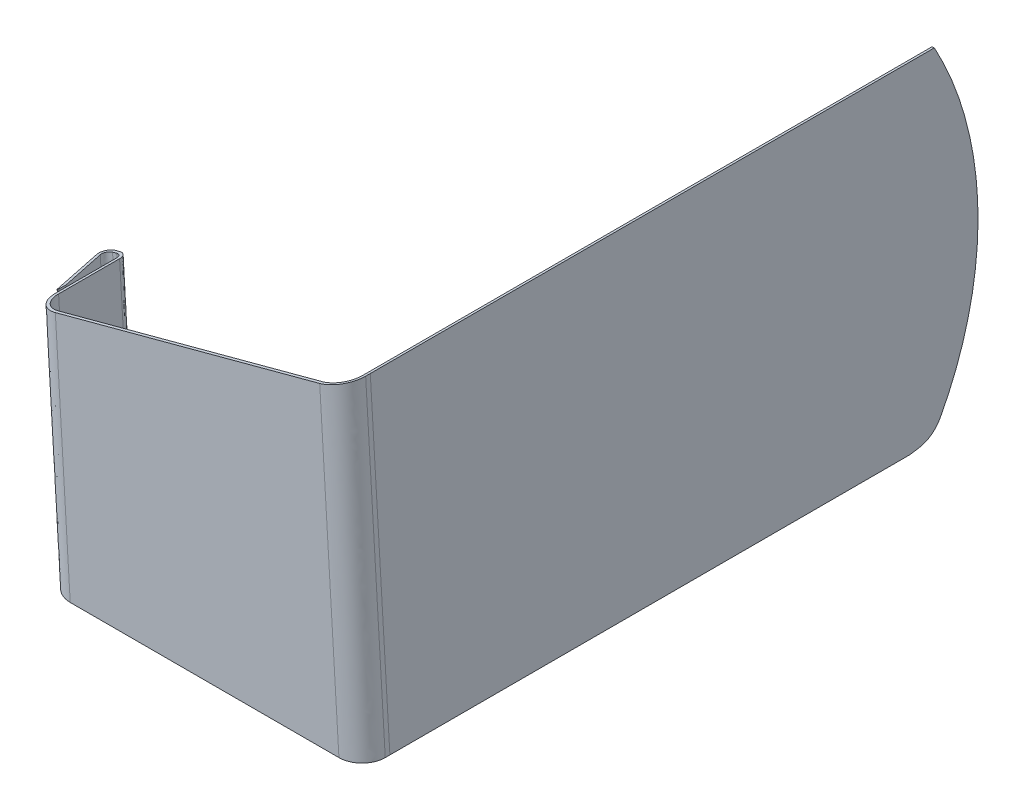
ISO-10303-21;
HEADER;
FILE_DESCRIPTION(('STEP AP214'),'2;1');
FILE_NAME('part.step','',(''),(''),'','','');
FILE_SCHEMA(('AUTOMOTIVE_DESIGN { 1 0 10303 214 1 1 1 1 }'));
ENDSEC;
DATA;
#1=APPLICATION_CONTEXT('core data for automotive mechanical design processes');
#2=APPLICATION_PROTOCOL_DEFINITION('international standard','automotive_design',2000,#1);
#3=PRODUCT_CONTEXT('',#1,'mechanical');
#4=PRODUCT('Part','Part','',(#3));
#5=PRODUCT_RELATED_PRODUCT_CATEGORY('part','',(#4));
#6=PRODUCT_DEFINITION_FORMATION('','',#4);
#7=PRODUCT_DEFINITION_CONTEXT('part definition',#1,'design');
#8=PRODUCT_DEFINITION('design','',#6,#7);
#9=PRODUCT_DEFINITION_SHAPE('','',#8);
#10=(LENGTH_UNIT() NAMED_UNIT(*) SI_UNIT(.MILLI.,.METRE.));
#11=(NAMED_UNIT(*) PLANE_ANGLE_UNIT() SI_UNIT($,.RADIAN.));
#12=(NAMED_UNIT(*) SI_UNIT($,.STERADIAN.) SOLID_ANGLE_UNIT());
#13=UNCERTAINTY_MEASURE_WITH_UNIT(LENGTH_MEASURE(1.E-05),#10,'distance_accuracy_value','');
#14=(GEOMETRIC_REPRESENTATION_CONTEXT(3) GLOBAL_UNCERTAINTY_ASSIGNED_CONTEXT((#13)) GLOBAL_UNIT_ASSIGNED_CONTEXT((#10,
#11,#12)) REPRESENTATION_CONTEXT('',''));
#15=CARTESIAN_POINT('',(0.,0.,0.));
#16=DIRECTION('',(0.,0.,1.));
#17=DIRECTION('',(1.,0.,0.));
#18=AXIS2_PLACEMENT_3D('',#15,#16,#17);
#19=CARTESIAN_POINT('',(1312.31348293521,0.,-26.825));
#20=DIRECTION('',(0.998134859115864,0.0610475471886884,0.));
#21=DIRECTION('',(-0.0610475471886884,0.998134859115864,0.));
#22=AXIS2_PLACEMENT_3D('',#19,#20,#21);
#23=PLANE('',#22);
#24=DIRECTION('',(0.00796830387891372,-0.130282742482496,0.99144486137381));
#25=VECTOR('',#24,1.);
#26=CARTESIAN_POINT('',(1316.74380967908,-72.4363838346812,-36.379250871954));
#27=LINE('',#26,#25);
#28=CARTESIAN_POINT('',(1312.23926548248,1.21346442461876,-596.850746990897));
#29=VERTEX_POINT('',#28);
#30=CARTESIAN_POINT('',(1312.31348293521,0.,-587.616346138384));
#31=VERTEX_POINT('',#30);
#32=EDGE_CURVE('E242',#29,#31,#27,.T.);
#33=ORIENTED_EDGE('',*,*,#32,.F.);
#34=CARTESIAN_POINT('',(1310.12088078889,35.8493131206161,-592.282330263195));
#35=DIRECTION('',(0.998134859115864,0.0610475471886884,0.));
#36=DIRECTION('',(-0.0610475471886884,0.998134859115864,0.));
#37=AXIS2_PLACEMENT_3D('',#34,#35,#36);
#38=CIRCLE('',#37,35.);
#39=CARTESIAN_POINT('',(1311.2575921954,17.2639426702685,-621.918320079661));
#40=VERTEX_POINT('',#39);
#41=EDGE_CURVE('E237',#40,#29,#38,.F.);
#42=ORIENTED_EDGE('',*,*,#41,.F.);
#43=CARTESIAN_POINT('',(1300.47602564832,193.54387367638,-340.824636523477));
#44=DIRECTION('',(0.998134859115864,0.0610475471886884,0.));
#45=DIRECTION('',(-0.0610475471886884,0.998134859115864,0.));
#46=AXIS2_PLACEMENT_3D('',#43,#44,#45);
#47=CIRCLE('',#46,331.970654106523);
#48=CARTESIAN_POINT('',(1291.15378703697,345.963614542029,-635.588666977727));
#49=VERTEX_POINT('',#48);
#50=EDGE_CURVE('E230',#49,#40,#47,.F.);
#51=ORIENTED_EDGE('',*,*,#50,.F.);
#52=DIRECTION('',(0.,0.,-1.));
#53=VECTOR('',#52,1.);
#54=CARTESIAN_POINT('',(1291.15378703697,345.963614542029,-26.825));
#55=LINE('',#54,#53);
#56=CARTESIAN_POINT('',(1291.15378703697,345.96361454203,-26.825));
#57=VERTEX_POINT('',#56);
#58=EDGE_CURVE('E478',#57,#49,#55,.T.);
#59=ORIENTED_EDGE('',*,*,#58,.F.);
#60=DIRECTION('',(-0.0610475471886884,0.998134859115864,0.));
#61=VECTOR('',#60,1.);
#62=CARTESIAN_POINT('',(1312.31348293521,0.,-26.825));
#63=LINE('',#62,#61);
#64=CARTESIAN_POINT('',(1312.31348293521,0.,-26.825));
#65=VERTEX_POINT('',#64);
#66=EDGE_CURVE('E584',#65,#57,#63,.T.);
#67=ORIENTED_EDGE('',*,*,#66,.F.);
#68=DIRECTION('',(0.,0.,-1.));
#69=VECTOR('',#68,1.);
#70=CARTESIAN_POINT('',(1312.31348293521,0.,-26.825));
#71=LINE('',#70,#69);
#72=EDGE_CURVE('E491',#65,#31,#71,.T.);
#73=ORIENTED_EDGE('',*,*,#72,.T.);
#74=EDGE_LOOP('',(#33,#42,#51,#59,#67,#73));
#75=FACE_BOUND('',#74,.T.);
#76=ADVANCED_FACE('F39',(#75),#23,.T.);
#77=CARTESIAN_POINT('',(1309.13848293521,0.,-26.825));
#78=DIRECTION('',(-0.998134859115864,-0.0610475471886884,0.));
#79=DIRECTION('',(0.0610475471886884,-0.998134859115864,0.));
#80=AXIS2_PLACEMENT_3D('',#77,#78,#79);
#81=PLANE('',#80);
#82=DIRECTION('',(-0.00796830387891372,0.130282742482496,-0.99144486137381));
#83=VECTOR('',#82,1.);
#84=CARTESIAN_POINT('',(1313.58044068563,-72.6265522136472,-36.4043337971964));
#85=LINE('',#84,#83);
#86=CARTESIAN_POINT('',(1309.13848293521,0.,-589.088600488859));
#87=VERTEX_POINT('',#86);
#88=CARTESIAN_POINT('',(1309.07609808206,1.01999997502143,-596.850746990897));
#89=VERTEX_POINT('',#88);
#90=EDGE_CURVE('E11',#87,#89,#85,.T.);
#91=ORIENTED_EDGE('',*,*,#90,.F.);
#92=DIRECTION('',(0.,0.,1.));
#93=VECTOR('',#92,1.);
#94=CARTESIAN_POINT('',(1309.13848293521,0.,-26.825));
#95=LINE('',#94,#93);
#96=CARTESIAN_POINT('',(1309.13848293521,0.,-26.825));
#97=VERTEX_POINT('',#96);
#98=EDGE_CURVE('E484',#87,#97,#95,.T.);
#99=ORIENTED_EDGE('',*,*,#98,.T.);
#100=DIRECTION('',(-0.0610475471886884,0.998134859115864,0.));
#101=VECTOR('',#100,1.);
#102=CARTESIAN_POINT('',(1309.13848293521,0.,-26.825));
#103=LINE('',#102,#101);
#104=CARTESIAN_POINT('',(1288.02998062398,345.126593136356,-26.825));
#105=VERTEX_POINT('',#104);
#106=EDGE_CURVE('E496',#97,#105,#103,.T.);
#107=ORIENTED_EDGE('',*,*,#106,.T.);
#108=DIRECTION('',(0.,0.,1.));
#109=VECTOR('',#108,1.);
#110=CARTESIAN_POINT('',(1288.02998062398,345.126593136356,-26.825));
#111=LINE('',#110,#109);
#112=CARTESIAN_POINT('',(1288.02998062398,345.126593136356,-635.921795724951));
#113=VERTEX_POINT('',#112);
#114=EDGE_CURVE('E235',#113,#105,#111,.T.);
#115=ORIENTED_EDGE('',*,*,#114,.F.);
#116=CARTESIAN_POINT('',(1297.3128582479,193.350409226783,-340.824636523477));
#117=DIRECTION('',(-0.998134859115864,-0.0610475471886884,0.));
#118=DIRECTION('',(0.0610475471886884,-0.998134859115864,0.));
#119=AXIS2_PLACEMENT_3D('',#116,#117,#118);
#120=CIRCLE('',#119,331.970654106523);
#121=CARTESIAN_POINT('',(1308.09442479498,17.0704782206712,-621.918320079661));
#122=VERTEX_POINT('',#121);
#123=EDGE_CURVE('E53',#122,#113,#120,.F.);
#124=ORIENTED_EDGE('',*,*,#123,.F.);
#125=CARTESIAN_POINT('',(1306.95771338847,35.6558486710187,-592.282330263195));
#126=DIRECTION('',(-0.998134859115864,-0.0610475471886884,0.));
#127=DIRECTION('',(0.0610475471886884,-0.998134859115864,0.));
#128=AXIS2_PLACEMENT_3D('',#125,#126,#127);
#129=CIRCLE('',#128,35.);
#130=EDGE_CURVE('E50',#89,#122,#129,.F.);
#131=ORIENTED_EDGE('',*,*,#130,.F.);
#132=EDGE_LOOP('',(#91,#99,#107,#115,#124,#131));
#133=FACE_BOUND('',#132,.T.);
#134=ADVANCED_FACE('F234',(#133),#81,.T.);
#135=CARTESIAN_POINT('',(1367.90079969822,366.527914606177,-672.79529063));
#136=DIRECTION('',(0.25881904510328,-0.965925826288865,0.));
#137=DIRECTION('',(0.965925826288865,0.25881904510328,0.));
#138=AXIS2_PLACEMENT_3D('',#135,#136,#137);
#139=PLANE('',#138);
#140=ORIENTED_EDGE('',*,*,#58,.T.);
#141=CARTESIAN_POINT('',(551.312877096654,147.723840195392,-340.824636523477));
#142=DIRECTION('',(0.25881904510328,-0.965925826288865,0.));
#143=DIRECTION('',(0.965925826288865,0.25881904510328,0.));
#144=AXIS2_PLACEMENT_3D('',#141,#142,#143);
#145=ELLIPSE('',#144,1665.10744498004,331.970654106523);
#146=EDGE_CURVE('E228',#49,#113,#145,.F.);
#147=ORIENTED_EDGE('',*,*,#146,.T.);
#148=ORIENTED_EDGE('',*,*,#114,.T.);
#149=DIRECTION('',(0.,0.,1.));
#150=VECTOR('',#149,1.);
#151=CARTESIAN_POINT('',(1288.02998062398,345.126593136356,-26.825));
#152=LINE('',#151,#150);
#153=CARTESIAN_POINT('',(1288.02998062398,345.126593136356,-21.825));
#154=VERTEX_POINT('',#153);
#155=EDGE_CURVE('E533',#105,#154,#152,.T.);
#156=ORIENTED_EDGE('',*,*,#155,.T.);
#157=CARTESIAN_POINT('',(1288.02998062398,345.126593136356,-21.825));
#158=CARTESIAN_POINT('',(1288.02999454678,345.126596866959,-21.4211887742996));
#159=CARTESIAN_POINT('',(1288.01895473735,345.123638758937,-21.017379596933));
#160=CARTESIAN_POINT('',(1287.97486982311,345.111826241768,-20.2110846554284));
#161=CARTESIAN_POINT('',(1287.94182657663,345.102972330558,-19.8085987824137));
#162=CARTESIAN_POINT('',(1287.85383819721,345.07939591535,-19.0062127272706));
#163=CARTESIAN_POINT('',(1287.7988936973,345.064673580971,-18.6063124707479));
#164=CARTESIAN_POINT('',(1287.66738478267,345.029435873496,-17.8108612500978));
#165=CARTESIAN_POINT('',(1287.5908476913,345.008927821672,-17.4153054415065));
#166=CARTESIAN_POINT('',(1287.41638982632,344.962181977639,-16.6292765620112));
#167=CARTESIAN_POINT('',(1287.31846911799,344.935944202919,-16.2388034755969));
#168=CARTESIAN_POINT('',(1287.10159724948,344.87783356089,-15.4641934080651));
#169=CARTESIAN_POINT('',(1286.9826462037,344.845960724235,-15.0800563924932));
#170=CARTESIAN_POINT('',(1286.65943273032,344.759355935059,-14.1289792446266));
#171=CARTESIAN_POINT('',(1286.44225548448,344.701163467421,-13.5666904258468));
#172=CARTESIAN_POINT('',(1285.96307379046,344.572767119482,-12.4628577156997));
#173=CARTESIAN_POINT('',(1285.70106303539,344.502561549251,-11.9213167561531));
#174=CARTESIAN_POINT('',(1285.27603241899,344.388674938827,-11.1275305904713));
#175=CARTESIAN_POINT('',(1285.12899994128,344.349277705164,-10.8659920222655));
#176=CARTESIAN_POINT('',(1284.82456880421,344.267705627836,-10.3495654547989));
#177=CARTESIAN_POINT('',(1284.66717307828,344.225531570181,-10.0946756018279));
#178=CARTESIAN_POINT('',(1284.17977404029,344.094933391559,-9.3404694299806));
#179=CARTESIAN_POINT('',(1283.83453755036,344.002427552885,-8.85157671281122));
#180=CARTESIAN_POINT('',(1283.10327455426,343.806486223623,-7.90137475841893));
#181=CARTESIAN_POINT('',(1282.71694504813,343.702969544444,-7.44031624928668));
#182=CARTESIAN_POINT('',(1281.90859656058,343.486373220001,-6.55302346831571));
#183=CARTESIAN_POINT('',(1281.48657728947,343.373293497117,-6.12678947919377));
#184=CARTESIAN_POINT('',(1280.60983797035,343.138371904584,-5.3118564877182));
#185=CARTESIAN_POINT('',(1280.15511121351,343.016528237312,-4.9231652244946));
#186=CARTESIAN_POINT('',(1279.21627927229,342.764968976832,-4.18589230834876));
#187=CARTESIAN_POINT('',(1278.73217413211,342.635253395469,-3.8373105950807));
#188=CARTESIAN_POINT('',(1277.72932411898,342.366540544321,-3.17673792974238));
#189=CARTESIAN_POINT('',(1277.21012315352,342.227421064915,-2.86548899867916));
#190=CARTESIAN_POINT('',(1276.14849882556,341.942959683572,-2.28873275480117));
#191=CARTESIAN_POINT('',(1275.60607401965,341.797617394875,-2.02322829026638));
#192=CARTESIAN_POINT('',(1274.50201411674,341.501785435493,-1.53971503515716));
#193=CARTESIAN_POINT('',(1273.94038435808,341.351297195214,-1.32169316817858));
#194=CARTESIAN_POINT('',(1272.80172645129,341.046194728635,-0.93442575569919));
#195=CARTESIAN_POINT('',(1272.2247013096,340.891581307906,-0.765170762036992));
#196=CARTESIAN_POINT('',(1271.22574235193,340.623911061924,-0.517681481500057));
#197=CARTESIAN_POINT('',(1270.80658334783,340.511597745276,-0.42725744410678));
#198=CARTESIAN_POINT('',(1269.9638614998,340.285791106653,-0.272066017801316));
#199=CARTESIAN_POINT('',(1269.54029893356,340.172297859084,-0.207297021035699));
#200=CARTESIAN_POINT('',(1268.69086413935,339.94469249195,-0.10369698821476));
#201=CARTESIAN_POINT('',(1268.26499623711,339.830581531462,-0.0648278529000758));
#202=CARTESIAN_POINT('',(1267.41171570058,339.601945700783,-0.0129702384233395));
#203=CARTESIAN_POINT('',(1266.98430280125,339.487420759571,1.35661145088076E-05));
#204=CARTESIAN_POINT('',(1266.55688614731,339.372894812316,0.));
#205=B_SPLINE_CURVE_WITH_KNOTS('',3,(#157,#158,#159,#160,#161,#162,#163,#164,#165,#166,#167,
#168,#169,#170,#171,#172,#173,#174,#175,#176,#177,#178,#179,#180,#181,#182,#183,#184,#185,#186,
#187,#188,#189,#190,#191,#192,#193,#194,#195,#196,#197,#198,#199,#200,#201,#202,#203,#204),
.UNSPECIFIED.,.F.,.F.,(4,2,2,2,2,2,2,2,2,2,2,2,2,2,2,2,2,2,2,2,2,2,2,4),(0.,1.21126882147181,
2.42243535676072,3.63356688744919,4.84317266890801,6.0527747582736,7.2623702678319,
9.07687536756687,10.8916359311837,11.7992373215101,12.7065829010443,14.5211379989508,
16.3501465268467,18.1791699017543,20.0085695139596,21.8379663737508,23.6991874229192,
25.5605243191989,27.4213479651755,29.2818108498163,30.6108991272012,31.9399040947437,
33.2669497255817,34.5942349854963),.UNSPECIFIED.);
#206=CARTESIAN_POINT('',(1266.55688614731,339.372894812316,0.));
#207=VERTEX_POINT('',#206);
#208=EDGE_CURVE('E291',#154,#207,#205,.T.);
#209=ORIENTED_EDGE('',*,*,#208,.T.);
#210=DIRECTION('',(-0.965925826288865,-0.25881904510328,0.));
#211=VECTOR('',#210,1.);
#212=CARTESIAN_POINT('',(1201.07983089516,321.828370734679,0.));
#213=LINE('',#212,#211);
#214=CARTESIAN_POINT('',(981.232835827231,262.920545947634,0.));
#215=VERTEX_POINT('',#214);
#216=EDGE_CURVE('E526',#207,#215,#213,.T.);
#217=ORIENTED_EDGE('',*,*,#216,.T.);
#218=CARTESIAN_POINT('',(981.232835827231,262.920545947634,0.));
#219=CARTESIAN_POINT('',(980.824667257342,262.811177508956,1.1768836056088E-05));
#220=CARTESIAN_POINT('',(980.416499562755,262.701809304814,-0.0118282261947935));
#221=CARTESIAN_POINT('',(979.601447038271,262.483416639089,-0.0591268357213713));
#222=CARTESIAN_POINT('',(979.194562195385,262.374392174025,-0.0945852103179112));
#223=CARTESIAN_POINT('',(978.383349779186,262.157028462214,-0.18903548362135));
#224=CARTESIAN_POINT('',(977.979022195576,262.048689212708,-0.248027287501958));
#225=CARTESIAN_POINT('',(977.174282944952,261.833059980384,-0.389359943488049));
#226=CARTESIAN_POINT('',(976.773870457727,261.725769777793,-0.471695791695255));
#227=CARTESIAN_POINT('',(975.978138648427,261.512554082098,-0.659493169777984));
#228=CARTESIAN_POINT('',(975.582819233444,261.406628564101,-0.764954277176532));
#229=CARTESIAN_POINT('',(974.798549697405,261.196484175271,-0.998692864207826));
#230=CARTESIAN_POINT('',(974.409599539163,261.092265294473,-1.12697021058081));
#231=CARTESIAN_POINT('',(973.446351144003,260.834163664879,-1.47587978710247));
#232=CARTESIAN_POINT('',(972.876756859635,260.681541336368,-1.71059531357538));
#233=CARTESIAN_POINT('',(971.75872768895,260.381966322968,-2.22918671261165));
#234=CARTESIAN_POINT('',(971.210295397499,260.23501433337,-2.51306859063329));
#235=CARTESIAN_POINT('',(970.406798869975,260.019718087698,-2.97420766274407));
#236=CARTESIAN_POINT('',(970.142158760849,259.948807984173,-3.13380667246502));
#237=CARTESIAN_POINT('',(969.619763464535,259.808832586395,-3.46448777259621));
#238=CARTESIAN_POINT('',(969.362006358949,259.73976677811,-3.6355666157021));
#239=CARTESIAN_POINT('',(968.599635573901,259.535490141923,-4.16570972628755));
#240=CARTESIAN_POINT('',(968.105868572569,259.403185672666,-4.54171147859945));
#241=CARTESIAN_POINT('',(967.15545985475,259.148524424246,-5.33269934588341));
#242=CARTESIAN_POINT('',(966.698535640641,259.026091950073,-5.74732280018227));
#243=CARTESIAN_POINT('',(965.820536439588,258.790832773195,-6.61547586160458));
#244=CARTESIAN_POINT('',(965.399461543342,258.678006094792,-7.06900556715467));
#245=CARTESIAN_POINT('',(964.596382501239,258.462821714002,-8.01188866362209));
#246=CARTESIAN_POINT('',(964.214385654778,258.360465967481,-8.50124871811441));
#247=CARTESIAN_POINT('',(963.492576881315,258.167057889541,-9.51223927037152));
#248=CARTESIAN_POINT('',(963.152763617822,258.076005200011,-10.0338687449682));
#249=CARTESIAN_POINT('',(962.523560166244,257.907410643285,-11.0963275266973));
#250=CARTESIAN_POINT('',(962.233397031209,257.829661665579,-11.6366663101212));
#251=CARTESIAN_POINT('',(961.698704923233,257.686391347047,-12.74107075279));
#252=CARTESIAN_POINT('',(961.454178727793,257.620870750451,-13.3051378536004));
#253=CARTESIAN_POINT('',(961.0129030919,257.502631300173,-14.4525036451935));
#254=CARTESIAN_POINT('',(960.816118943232,257.449903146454,-15.0357880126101));
#255=CARTESIAN_POINT('',(960.471745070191,257.357628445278,-16.2174710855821));
#256=CARTESIAN_POINT('',(960.32414101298,257.318078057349,-16.8158653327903));
#257=CARTESIAN_POINT('',(960.054862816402,257.245925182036,-18.1440479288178));
#258=CARTESIAN_POINT('',(959.944196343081,257.21627218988,-18.8762837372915));
#259=CARTESIAN_POINT('',(959.833541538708,257.18662232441,-19.9796688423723));
#260=CARTESIAN_POINT('',(959.805880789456,257.179210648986,-20.3480741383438));
#261=CARTESIAN_POINT('',(959.768979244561,257.169322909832,-21.0859608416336));
#262=CARTESIAN_POINT('',(959.759742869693,257.166848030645,-21.4554424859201));
#263=CARTESIAN_POINT('',(959.759741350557,257.166847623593,-21.825));
#264=B_SPLINE_CURVE_WITH_KNOTS('',3,(#218,#219,#220,#221,#222,#223,#224,#225,#226,#227,#228,
#229,#230,#231,#232,#233,#234,#235,#236,#237,#238,#239,#240,#241,#242,#243,#244,#245,#246,#247,
#248,#249,#250,#251,#252,#253,#254,#255,#256,#257,#258,#259,#260,#261,#262,#263),.UNSPECIFIED.,
.F.,.F.,(4,2,2,2,2,2,2,2,2,2,2,2,2,2,2,2,2,2,2,2,2,2,4),(0.,1.26753446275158,2.53505605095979,
3.80257253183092,5.06981752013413,6.33703935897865,7.60425379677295,9.5059484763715,
11.4078756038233,12.3588385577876,13.3095336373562,15.2107331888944,17.0955997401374,
18.9804710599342,20.8656938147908,22.7508568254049,24.6032928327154,26.4558415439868,
28.3070393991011,30.1576972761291,32.3766873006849,33.4848190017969,34.5932165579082),.UNSPECIFIED.);
#265=CARTESIAN_POINT('',(959.759741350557,257.166847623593,-21.825));
#266=VERTEX_POINT('',#265);
#267=EDGE_CURVE('E285',#215,#266,#264,.T.);
#268=ORIENTED_EDGE('',*,*,#267,.T.);
#269=DIRECTION('',(0.,0.,-1.));
#270=VECTOR('',#269,1.);
#271=CARTESIAN_POINT('',(959.759741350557,257.166847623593,-21.825));
#272=LINE('',#271,#270);
#273=CARTESIAN_POINT('',(959.759741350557,257.166847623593,-87.65));
#274=VERTEX_POINT('',#273);
#275=EDGE_CURVE('E885',#266,#274,#272,.T.);
#276=ORIENTED_EDGE('',*,*,#275,.T.);
#277=CARTESIAN_POINT('',(959.759741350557,257.166847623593,-87.65));
#278=CARTESIAN_POINT('',(959.75977098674,257.166855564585,-87.9046334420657));
#279=CARTESIAN_POINT('',(959.749313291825,257.164053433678,-88.1592611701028));
#280=CARTESIAN_POINT('',(959.707638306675,257.152886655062,-88.6666684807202));
#281=CARTESIAN_POINT('',(959.676422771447,257.144522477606,-88.9194482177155));
#282=CARTESIAN_POINT('',(959.593499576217,257.122303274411,-89.4210490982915));
#283=CARTESIAN_POINT('',(959.54181788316,257.108455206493,-89.6698748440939));
#284=CARTESIAN_POINT('',(959.418378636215,257.075379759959,-90.1621276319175));
#285=CARTESIAN_POINT('',(959.346621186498,257.056152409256,-90.4055547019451));
#286=CARTESIAN_POINT('',(959.183565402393,257.012461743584,-90.8853658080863));
#287=CARTESIAN_POINT('',(959.0922615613,256.987996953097,-91.1217478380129));
#288=CARTESIAN_POINT('',(958.890829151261,256.934023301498,-91.5857579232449));
#289=CARTESIAN_POINT('',(958.7807001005,256.904514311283,-91.8133857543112));
#290=CARTESIAN_POINT('',(958.54246611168,256.840679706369,-92.2583059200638));
#291=CARTESIAN_POINT('',(958.414362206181,256.806354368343,-92.4755988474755));
#292=CARTESIAN_POINT('',(958.141137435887,256.733144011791,-92.8983951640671));
#293=CARTESIAN_POINT('',(957.996016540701,256.69425898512,-93.1038985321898));
#294=CARTESIAN_POINT('',(957.68863522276,256.611896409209,-93.5033054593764));
#295=CARTESIAN_POINT('',(957.526249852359,256.568385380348,-93.6971059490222));
#296=CARTESIAN_POINT('',(957.186430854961,256.477331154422,-94.0701234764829));
#297=CARTESIAN_POINT('',(957.00899236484,256.429786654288,-94.2493357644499));
#298=CARTESIAN_POINT('',(956.640393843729,256.331020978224,-94.5919491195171));
#299=CARTESIAN_POINT('',(956.449233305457,256.27979966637,-94.7553496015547));
#300=CARTESIAN_POINT('',(956.054558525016,256.174046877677,-95.0652920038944));
#301=CARTESIAN_POINT('',(955.851044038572,256.119515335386,-95.2118335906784));
#302=CARTESIAN_POINT('',(955.429413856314,256.006539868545,-95.4895590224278));
#303=CARTESIAN_POINT('',(955.211104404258,255.948044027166,-95.620427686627));
#304=CARTESIAN_POINT('',(954.764807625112,255.828459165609,-95.8628824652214));
#305=CARTESIAN_POINT('',(954.536823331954,255.767370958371,-95.9744745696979));
#306=CARTESIAN_POINT('',(954.072722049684,255.64301539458,-96.1777205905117));
#307=CARTESIAN_POINT('',(953.836605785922,255.579748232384,-96.2693762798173));
#308=CARTESIAN_POINT('',(953.357961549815,255.451495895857,-96.4321751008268));
#309=CARTESIAN_POINT('',(953.115434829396,255.386511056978,-96.5033222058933));
#310=CARTESIAN_POINT('',(952.520489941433,255.227096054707,-96.6506978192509));
#311=CARTESIAN_POINT('',(952.165475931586,255.131970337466,-96.7160620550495));
#312=CARTESIAN_POINT('',(951.629747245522,254.988422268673,-96.7814157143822));
#313=CARTESIAN_POINT('',(951.450733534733,254.940455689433,-96.7977514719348));
#314=CARTESIAN_POINT('',(951.092056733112,254.844348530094,-96.8195430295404));
#315=CARTESIAN_POINT('',(950.912393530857,254.79620792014,-96.8249968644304));
#316=CARTESIAN_POINT('',(950.732678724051,254.748053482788,-96.825));
#317=B_SPLINE_CURVE_WITH_KNOTS('',3,(#277,#278,#279,#280,#281,#282,#283,#284,#285,#286,#287,
#288,#289,#290,#291,#292,#293,#294,#295,#296,#297,#298,#299,#300,#301,#302,#303,#304,#305,#306,
#307,#308,#309,#310,#311,#312,#313,#314,#315,#316),.UNSPECIFIED.,.F.,.F.,(4,2,2,2,2,2,2,2,2,2,2,
2,2,2,2,2,2,2,2,4),(0.,0.76366187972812,1.52725920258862,2.28989078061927,3.05251840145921,
3.81536115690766,4.5782234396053,5.34104191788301,6.1038617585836,6.87263613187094,
7.64165982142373,8.41071195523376,9.17977930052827,9.96236317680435,10.7447034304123,
11.5269740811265,12.3090930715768,13.4260444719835,13.9839204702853,14.5418972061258),.UNSPECIFIED.);
#318=CARTESIAN_POINT('',(950.732678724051,254.748053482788,-96.825));
#319=VERTEX_POINT('',#318);
#320=EDGE_CURVE('E274',#274,#319,#317,.T.);
#321=ORIENTED_EDGE('',*,*,#320,.T.);
#322=DIRECTION('',(-0.965925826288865,-0.25881904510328,0.));
#323=VECTOR('',#322,1.);
#324=CARTESIAN_POINT('',(901.582753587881,241.57837073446,-96.8249999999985));
#325=LINE('',#324,#323);
#326=CARTESIAN_POINT('',(946.174677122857,253.526740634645,-96.8249999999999));
#327=VERTEX_POINT('',#326);
#328=EDGE_CURVE('E255',#319,#327,#325,.T.);
#329=ORIENTED_EDGE('',*,*,#328,.T.);
#330=CARTESIAN_POINT('',(946.174677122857,253.526740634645,-96.8249999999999));
#331=CARTESIAN_POINT('',(945.917301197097,253.457776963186,-96.8250251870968));
#332=CARTESIAN_POINT('',(945.65992746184,253.388813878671,-96.8138133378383));
#333=CARTESIAN_POINT('',(945.146995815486,253.251374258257,-96.7690964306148));
#334=CARTESIAN_POINT('',(944.891437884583,253.182897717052,-96.7355916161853));
#335=CARTESIAN_POINT('',(944.383981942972,253.046925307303,-96.646476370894));
#336=CARTESIAN_POINT('',(944.132083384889,252.97942929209,-96.5908692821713));
#337=CARTESIAN_POINT('',(943.633702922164,252.845888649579,-96.4579098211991));
#338=CARTESIAN_POINT('',(943.38722091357,252.779843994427,-96.3805578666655));
#339=CARTESIAN_POINT('',(942.901279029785,252.649636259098,-96.20454184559));
#340=CARTESIAN_POINT('',(942.661823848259,252.585474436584,-96.1058638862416));
#341=CARTESIAN_POINT('',(942.191842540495,252.459543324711,-95.8878630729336));
#342=CARTESIAN_POINT('',(941.961316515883,252.397774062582,-95.7685399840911));
#343=CARTESIAN_POINT('',(941.510971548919,252.277104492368,-95.5100761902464));
#344=CARTESIAN_POINT('',(941.29114907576,252.218203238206,-95.3709420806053));
#345=CARTESIAN_POINT('',(940.863777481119,252.103689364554,-95.073756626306));
#346=CARTESIAN_POINT('',(940.656228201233,252.048076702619,-94.9157055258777));
#347=CARTESIAN_POINT('',(940.256692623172,251.941021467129,-94.5831844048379));
#348=CARTESIAN_POINT('',(940.064588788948,251.889547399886,-94.4088657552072));
#349=CARTESIAN_POINT('',(939.695465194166,251.790641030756,-94.0438793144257));
#350=CARTESIAN_POINT('',(939.518445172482,251.743208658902,-93.853211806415));
#351=CARTESIAN_POINT('',(939.180846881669,251.652749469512,-93.4568348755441));
#352=CARTESIAN_POINT('',(939.020269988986,251.609723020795,-93.2511241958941));
#353=CARTESIAN_POINT('',(938.716846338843,251.528420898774,-92.8261351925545));
#354=CARTESIAN_POINT('',(938.573999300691,251.49014515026,-92.606857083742));
#355=CARTESIAN_POINT('',(938.309550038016,251.419286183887,-92.1603142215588));
#356=CARTESIAN_POINT('',(938.187616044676,251.386614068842,-91.9332600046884));
#357=CARTESIAN_POINT('',(937.962924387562,251.326408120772,-91.4692010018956));
#358=CARTESIAN_POINT('',(937.860166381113,251.298874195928,-91.2321963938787));
#359=CARTESIAN_POINT('',(937.674637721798,251.249161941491,-90.7499158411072));
#360=CARTESIAN_POINT('',(937.591869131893,251.226984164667,-90.5046390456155));
#361=CARTESIAN_POINT('',(937.447005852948,251.188168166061,-90.0076337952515));
#362=CARTESIAN_POINT('',(937.384910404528,251.171529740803,-89.7559055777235));
#363=CARTESIAN_POINT('',(937.282707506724,251.144144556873,-89.2518438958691));
#364=CARTESIAN_POINT('',(937.242269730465,251.13330928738,-88.9995821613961));
#365=CARTESIAN_POINT('',(937.182234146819,251.117222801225,-88.4924205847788));
#366=CARTESIAN_POINT('',(937.162635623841,251.11197139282,-88.2375208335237));
#367=CARTESIAN_POINT('',(937.1444421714,251.107096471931,-87.7271839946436));
#368=CARTESIAN_POINT('',(937.145825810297,251.107467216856,-87.4717477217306));
#369=CARTESIAN_POINT('',(937.16953069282,251.113818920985,-86.9620151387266));
#370=CARTESIAN_POINT('',(937.191842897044,251.119797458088,-86.7077183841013));
#371=CARTESIAN_POINT('',(937.250265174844,251.135451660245,-86.2557359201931));
#372=CARTESIAN_POINT('',(937.282439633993,251.144072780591,-86.0574946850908));
#373=CARTESIAN_POINT('',(937.359413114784,251.164697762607,-85.6640350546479));
#374=CARTESIAN_POINT('',(937.404188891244,251.17669539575,-85.4688117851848));
#375=CARTESIAN_POINT('',(937.455204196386,251.190364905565,-85.2753352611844));
#376=B_SPLINE_CURVE_WITH_KNOTS('',3,(#330,#331,#332,#333,#334,#335,#336,#337,#338,#339,#340,
#341,#342,#343,#344,#345,#346,#347,#348,#349,#350,#351,#352,#353,#354,#355,#356,#357,#358,#359,
#360,#361,#362,#363,#364,#365,#366,#367,#368,#369,#370,#371,#372,#373,#374,#375),.UNSPECIFIED.,
.F.,.F.,(4,2,2,2,2,2,2,2,2,2,2,2,2,2,2,2,2,2,2,2,2,2,4),(0.,0.799126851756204,1.59824497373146,
2.39724230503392,3.19622428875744,3.99572834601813,4.79524149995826,5.59448910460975,
6.39372639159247,7.18615380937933,7.9785675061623,8.77104748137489,9.56351490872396,
10.3419317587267,11.1203346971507,11.8988179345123,12.6772725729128,13.4434891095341,
14.2096793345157,14.9750870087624,15.7401642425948,16.3427929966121,16.9443173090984),.UNSPECIFIED.);
#377=CARTESIAN_POINT('',(937.455204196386,251.190364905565,-85.2753352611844));
#378=VERTEX_POINT('',#377);
#379=EDGE_CURVE('E64',#327,#378,#376,.T.);
#380=ORIENTED_EDGE('',*,*,#379,.T.);
#381=DIRECTION('',(0.25432651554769,0.0681465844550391,0.96471450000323));
#382=VECTOR('',#381,1.);
#383=CARTESIAN_POINT('',(934.095425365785,250.290114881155,-98.0196900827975));
#384=LINE('',#383,#382);
#385=CARTESIAN_POINT('',(952.73395555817,255.284293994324,-27.3197856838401));
#386=VERTEX_POINT('',#385);
#387=EDGE_CURVE('E467',#378,#386,#384,.T.);
#388=ORIENTED_EDGE('',*,*,#387,.T.);
#389=DIRECTION('',(0.934144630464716,0.250303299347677,-0.25440532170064));
#390=VECTOR('',#389,1.);
#391=CARTESIAN_POINT('',(906.87878121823,242.99743706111,-14.8315691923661));
#392=LINE('',#391,#390);
#393=CARTESIAN_POINT('',(952.955076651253,255.343543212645,-27.3800058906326));
#394=VERTEX_POINT('',#393);
#395=EDGE_CURVE('E535',#386,#394,#392,.T.);
#396=ORIENTED_EDGE('',*,*,#395,.T.);
#397=CARTESIAN_POINT('',(952.955076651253,255.343543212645,-27.3800058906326));
#398=CARTESIAN_POINT('',(953.008821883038,255.357944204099,-27.3945957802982));
#399=CARTESIAN_POINT('',(953.061364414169,255.372022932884,-27.4139145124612));
#400=CARTESIAN_POINT('',(953.162624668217,255.399155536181,-27.4613389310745));
#401=CARTESIAN_POINT('',(953.2113414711,255.412209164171,-27.489446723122));
#402=CARTESIAN_POINT('',(953.303538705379,255.436913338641,-27.5537953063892));
#403=CARTESIAN_POINT('',(953.347015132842,255.44856281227,-27.5900422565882));
#404=CARTESIAN_POINT('',(953.427359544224,255.470091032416,-27.6696475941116));
#405=CARTESIAN_POINT('',(953.464231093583,255.47997073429,-27.7130021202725));
#406=CARTESIAN_POINT('',(953.529831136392,255.497548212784,-27.8050493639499));
#407=CARTESIAN_POINT('',(953.558654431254,255.505271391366,-27.8536696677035));
#408=CARTESIAN_POINT('',(953.607851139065,255.518453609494,-27.9553100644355));
#409=CARTESIAN_POINT('',(953.628224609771,255.523912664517,-28.0083301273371));
#410=CARTESIAN_POINT('',(953.657357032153,255.531718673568,-28.1086168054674));
#411=CARTESIAN_POINT('',(953.66743873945,255.534420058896,-28.1554767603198));
#412=CARTESIAN_POINT('',(953.680924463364,255.538033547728,-28.2501950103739));
#413=CARTESIAN_POINT('',(953.684331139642,255.538946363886,-28.298052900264));
#414=CARTESIAN_POINT('',(953.68430683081,255.538939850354,-28.3459317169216));
#415=B_SPLINE_CURVE_WITH_KNOTS('',3,(#397,#398,#399,#400,#401,#402,#403,#404,#405,#406,#407,
#408,#409,#410,#411,#412,#413,#414),.UNSPECIFIED.,.F.,.F.,(4,2,2,2,2,2,2,2,4),(0.,
0.172362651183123,0.344766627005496,0.517301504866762,0.689742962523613,0.860058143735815,
1.03037216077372,1.17389910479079,1.31736884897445),.UNSPECIFIED.);
#416=CARTESIAN_POINT('',(953.68430683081,255.538939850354,-28.3459317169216));
#417=VERTEX_POINT('',#416);
#418=EDGE_CURVE('E304',#394,#417,#415,.T.);
#419=ORIENTED_EDGE('',*,*,#418,.T.);
#420=DIRECTION('',(0.,0.,-1.));
#421=VECTOR('',#420,1.);
#422=CARTESIAN_POINT('',(953.68430683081,255.538939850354,-28.3459317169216));
#423=LINE('',#422,#421);
#424=CARTESIAN_POINT('',(953.68430683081,255.538939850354,-35.8505069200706));
#425=VERTEX_POINT('',#424);
#426=EDGE_CURVE('E536',#417,#425,#423,.T.);
#427=ORIENTED_EDGE('',*,*,#426,.T.);
#428=CARTESIAN_POINT('',(953.68430683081,255.538939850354,-35.8505069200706));
#429=CARTESIAN_POINT('',(953.684308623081,255.538940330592,-35.8724046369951));
#430=CARTESIAN_POINT('',(953.683599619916,255.538750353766,-35.8942989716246));
#431=CARTESIAN_POINT('',(953.680770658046,255.537992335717,-35.9379897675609));
#432=CARTESIAN_POINT('',(953.678650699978,255.537424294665,-35.959786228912));
#433=CARTESIAN_POINT('',(953.670229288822,255.535167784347,-36.0245924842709));
#434=CARTESIAN_POINT('',(953.661865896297,255.532926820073,-36.0673240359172));
#435=CARTESIAN_POINT('',(953.650782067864,255.529956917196,-36.1093259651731));
#436=B_SPLINE_CURVE_WITH_KNOTS('',3,(#428,#429,#430,#431,#432,#433,#434,#435),.UNSPECIFIED.,.F.,
.F.,(4,2,2,4),(0.,0.0656741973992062,0.131348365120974,0.261789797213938),.UNSPECIFIED.);
#437=CARTESIAN_POINT('',(953.650782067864,255.529956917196,-36.1093259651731));
#438=VERTEX_POINT('',#437);
#439=EDGE_CURVE('E313',#425,#438,#436,.T.);
#440=ORIENTED_EDGE('',*,*,#439,.T.);
#441=DIRECTION('',(-0.254326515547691,-0.0681465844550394,-0.96471450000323));
#442=VECTOR('',#441,1.);
#443=CARTESIAN_POINT('',(950.232959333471,254.61415407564,-49.0738536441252));
#444=LINE('',#443,#442);
#445=CARTESIAN_POINT('',(940.472569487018,251.998865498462,-86.0970857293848));
#446=VERTEX_POINT('',#445);
#447=EDGE_CURVE('E537',#438,#446,#444,.T.);
#448=ORIENTED_EDGE('',*,*,#447,.T.);
#449=CARTESIAN_POINT('',(940.472569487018,251.998865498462,-86.0970857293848));
#450=CARTESIAN_POINT('',(940.430360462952,251.98755562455,-86.2571187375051));
#451=CARTESIAN_POINT('',(940.394693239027,251.977998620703,-86.4189995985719));
#452=CARTESIAN_POINT('',(940.33664161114,251.962443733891,-86.7452882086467));
#453=CARTESIAN_POINT('',(940.314256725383,251.95644572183,-86.9096958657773));
#454=CARTESIAN_POINT('',(940.28297969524,251.948065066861,-87.2397354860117));
#455=CARTESIAN_POINT('',(940.274075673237,251.945679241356,-87.4053662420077));
#456=CARTESIAN_POINT('',(940.269787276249,251.944530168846,-87.7368120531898));
#457=CARTESIAN_POINT('',(940.274402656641,251.945766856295,-87.9026271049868));
#458=CARTESIAN_POINT('',(940.297121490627,251.951854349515,-88.2333198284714));
#459=CARTESIAN_POINT('',(940.315229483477,251.956706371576,-88.3981971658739));
#460=CARTESIAN_POINT('',(940.364804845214,251.969990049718,-88.7258468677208));
#461=CARTESIAN_POINT('',(940.396277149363,251.978423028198,-88.8886184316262));
#462=CARTESIAN_POINT('',(940.472313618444,251.998796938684,-89.2107526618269));
#463=CARTESIAN_POINT('',(940.516870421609,252.010735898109,-89.3701171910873));
#464=CARTESIAN_POINT('',(940.618754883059,252.038035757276,-89.6844735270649));
#465=CARTESIAN_POINT('',(940.676087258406,252.053397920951,-89.8394636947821));
#466=CARTESIAN_POINT('',(940.803166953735,252.087448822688,-90.1441631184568));
#467=CARTESIAN_POINT('',(940.872932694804,252.106142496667,-90.2938641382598));
#468=CARTESIAN_POINT('',(941.024315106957,252.146705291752,-90.5867649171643));
#469=CARTESIAN_POINT('',(941.105935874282,252.168575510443,-90.7299624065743));
#470=CARTESIAN_POINT('',(941.280396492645,252.215322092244,-91.0088332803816));
#471=CARTESIAN_POINT('',(941.373236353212,252.240198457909,-91.1445066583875));
#472=CARTESIAN_POINT('',(941.569448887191,252.292773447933,-91.4074295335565));
#473=CARTESIAN_POINT('',(941.672821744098,252.320472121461,-91.5346788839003));
#474=CARTESIAN_POINT('',(941.890716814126,252.37885692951,-91.7814726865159));
#475=CARTESIAN_POINT('',(942.005363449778,252.409576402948,-91.9008994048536));
#476=CARTESIAN_POINT('',(942.243805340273,252.473466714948,-92.1294393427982));
#477=CARTESIAN_POINT('',(942.367597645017,252.506636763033,-92.2385558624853));
#478=CARTESIAN_POINT('',(942.623535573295,252.575215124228,-92.4458681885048));
#479=CARTESIAN_POINT('',(942.755685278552,252.610624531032,-92.5440585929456));
#480=CARTESIAN_POINT('',(943.027299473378,252.683403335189,-92.7288037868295));
#481=CARTESIAN_POINT('',(943.166761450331,252.720772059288,-92.8153625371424));
#482=CARTESIAN_POINT('',(943.454709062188,252.797927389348,-92.9778350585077));
#483=CARTESIAN_POINT('',(943.603313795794,252.837745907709,-93.053522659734));
#484=CARTESIAN_POINT('',(943.906037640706,252.918860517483,-93.1918084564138));
#485=CARTESIAN_POINT('',(944.060154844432,252.960156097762,-93.2544111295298));
#486=CARTESIAN_POINT('',(944.372801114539,253.043929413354,-93.3661442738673));
#487=CARTESIAN_POINT('',(944.531328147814,253.086406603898,-93.4152808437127));
#488=CARTESIAN_POINT('',(944.851708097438,253.172252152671,-93.4998038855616));
#489=CARTESIAN_POINT('',(945.0135598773,253.215620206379,-93.5351949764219));
#490=CARTESIAN_POINT('',(945.341511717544,253.303494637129,-93.592375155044));
#491=CARTESIAN_POINT('',(945.507639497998,253.348008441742,-93.6139939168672));
#492=CARTESIAN_POINT('',(945.840738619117,253.437262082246,-93.6428006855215));
#493=CARTESIAN_POINT('',(946.007707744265,253.48200132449,-93.650016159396));
#494=CARTESIAN_POINT('',(946.174677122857,253.526740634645,-93.65));
#495=B_SPLINE_CURVE_WITH_KNOTS('',3,(#449,#450,#451,#452,#453,#454,#455,#456,#457,#458,#459,
#460,#461,#462,#463,#464,#465,#466,#467,#468,#469,#470,#471,#472,#473,#474,#475,#476,#477,#478,
#479,#480,#481,#482,#483,#484,#485,#486,#487,#488,#489,#490,#491,#492,#493,#494),.UNSPECIFIED.,
.F.,.F.,(4,2,2,2,2,2,2,2,2,2,2,2,2,2,2,2,2,2,2,2,2,2,4),(0.,0.497526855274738,0.995035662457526,
1.49210587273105,1.98916708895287,2.48639560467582,2.98380790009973,3.48094086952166,
3.97825769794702,4.47631756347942,4.97454993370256,5.47278272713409,5.97102420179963,
6.47556406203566,6.97994187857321,7.48456796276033,7.98902177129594,8.50279387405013,
9.01638987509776,9.52975288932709,10.0429432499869,10.5623630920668,11.0807914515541),.UNSPECIFIED.);
#496=CARTESIAN_POINT('',(946.174677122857,253.526740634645,-93.65));
#497=VERTEX_POINT('',#496);
#498=EDGE_CURVE('E319',#446,#497,#495,.T.);
#499=ORIENTED_EDGE('',*,*,#498,.T.);
#500=DIRECTION('',(0.965925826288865,0.25881904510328,0.));
#501=VECTOR('',#500,1.);
#502=CARTESIAN_POINT('',(901.582753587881,241.57837073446,-93.6499999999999));
#503=LINE('',#502,#501);
#504=CARTESIAN_POINT('',(950.732678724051,254.748053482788,-93.65));
#505=VERTEX_POINT('',#504);
#506=EDGE_CURVE('E545',#497,#505,#503,.T.);
#507=ORIENTED_EDGE('',*,*,#506,.T.);
#508=CARTESIAN_POINT('',(950.732678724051,254.748053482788,-93.65));
#509=CARTESIAN_POINT('',(950.900995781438,254.793153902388,-93.6500164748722));
#510=CARTESIAN_POINT('',(951.069311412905,254.838253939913,-93.6426839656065));
#511=CARTESIAN_POINT('',(951.404755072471,254.9281357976,-93.6134392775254));
#512=CARTESIAN_POINT('',(951.571883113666,254.972917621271,-93.5915272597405));
#513=CARTESIAN_POINT('',(951.90373407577,255.061836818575,-93.5332482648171));
#514=CARTESIAN_POINT('',(952.068457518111,255.105974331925,-93.496884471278));
#515=CARTESIAN_POINT('',(952.394362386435,255.193300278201,-93.4099375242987));
#516=CARTESIAN_POINT('',(952.555543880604,255.236488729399,-93.3593546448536));
#517=CARTESIAN_POINT('',(952.873290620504,255.321628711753,-93.2442616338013));
#518=CARTESIAN_POINT('',(953.029853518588,255.36357961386,-93.179744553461));
#519=CARTESIAN_POINT('',(953.337197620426,255.445932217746,-93.0371890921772));
#520=CARTESIAN_POINT('',(953.487976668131,255.486333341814,-92.9591457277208));
#521=CARTESIAN_POINT('',(953.782480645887,255.565245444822,-92.7901234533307));
#522=CARTESIAN_POINT('',(953.926210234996,255.603757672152,-92.699153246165));
#523=CARTESIAN_POINT('',(954.205695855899,255.67864561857,-92.5048113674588));
#524=CARTESIAN_POINT('',(954.341449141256,255.715020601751,-92.401435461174));
#525=CARTESIAN_POINT('',(954.602743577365,255.785034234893,-92.1839681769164));
#526=CARTESIAN_POINT('',(954.72836374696,255.818694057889,-92.0699785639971));
#527=CARTESIAN_POINT('',(954.969740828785,255.883370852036,-91.8313089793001));
#528=CARTESIAN_POINT('',(955.08549791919,255.914387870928,-91.7066292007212));
#529=CARTESIAN_POINT('',(955.306292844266,255.973549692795,-91.4473967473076));
#530=CARTESIAN_POINT('',(955.411326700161,256.001693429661,-91.3128404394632));
#531=CARTESIAN_POINT('',(955.609758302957,256.054863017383,-91.0349017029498));
#532=CARTESIAN_POINT('',(955.703160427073,256.079890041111,-90.8915226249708));
#533=CARTESIAN_POINT('',(955.876141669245,256.126240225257,-90.5994303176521));
#534=CARTESIAN_POINT('',(955.955928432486,256.147619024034,-90.4508488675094));
#535=CARTESIAN_POINT('',(956.102917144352,256.187004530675,-90.1472295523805));
#536=CARTESIAN_POINT('',(956.170124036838,256.205012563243,-89.9921942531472));
#537=CARTESIAN_POINT('',(956.291423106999,256.237514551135,-89.6768031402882));
#538=CARTESIAN_POINT('',(956.345521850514,256.252010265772,-89.5164500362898));
#539=CARTESIAN_POINT('',(956.440195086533,256.277377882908,-89.1915886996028));
#540=CARTESIAN_POINT('',(956.480773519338,256.288250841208,-89.027081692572));
#541=CARTESIAN_POINT('',(956.554801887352,256.308086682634,-88.6619455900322));
#542=CARTESIAN_POINT('',(956.585225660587,256.316238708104,-88.4606436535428));
#543=CARTESIAN_POINT('',(956.61564767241,256.324390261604,-88.1572931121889));
#544=CARTESIAN_POINT('',(956.623252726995,256.326428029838,-88.0559988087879));
#545=CARTESIAN_POINT('',(956.633396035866,256.329145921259,-87.8531432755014));
#546=CARTESIAN_POINT('',(956.635934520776,256.32982610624,-87.7515820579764));
#547=CARTESIAN_POINT('',(956.63593493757,256.32982621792,-87.65));
#548=B_SPLINE_CURVE_WITH_KNOTS('',3,(#508,#509,#510,#511,#512,#513,#514,#515,#516,#517,#518,
#519,#520,#521,#522,#523,#524,#525,#526,#527,#528,#529,#530,#531,#532,#533,#534,#535,#536,#537,
#538,#539,#540,#541,#542,#543,#544,#545,#546,#547),.UNSPECIFIED.,.F.,.F.,(4,2,2,2,2,2,2,2,2,2,2,
2,2,2,2,2,2,2,2,4),(0.,0.522607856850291,1.04520994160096,1.56769696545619,2.09017392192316,
2.61291203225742,3.13584314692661,3.65842386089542,4.1811834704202,4.69936517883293,
5.21753752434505,5.73590144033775,6.25406969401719,6.76344624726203,7.27262219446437,
7.78154256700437,8.29031449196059,8.90034611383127,9.20503060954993,9.50970123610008),.UNSPECIFIED.);
#549=CARTESIAN_POINT('',(956.63593493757,256.32982621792,-87.65));
#550=VERTEX_POINT('',#549);
#551=EDGE_CURVE('E327',#505,#550,#548,.T.);
#552=ORIENTED_EDGE('',*,*,#551,.T.);
#553=DIRECTION('',(0.,0.,1.));
#554=VECTOR('',#553,1.);
#555=CARTESIAN_POINT('',(956.63593493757,256.32982621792,-21.825));
#556=LINE('',#555,#554);
#557=CARTESIAN_POINT('',(956.63593493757,256.32982621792,-21.825));
#558=VERTEX_POINT('',#557);
#559=EDGE_CURVE('E342',#550,#558,#556,.T.);
#560=ORIENTED_EDGE('',*,*,#559,.T.);
#561=CARTESIAN_POINT('',(956.63593493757,256.32982621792,-21.825));
#562=CARTESIAN_POINT('',(956.635918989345,256.329821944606,-21.3624441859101));
#563=CARTESIAN_POINT('',(956.648564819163,256.333210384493,-20.8998907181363));
#564=CARTESIAN_POINT('',(956.699063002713,256.346741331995,-19.9762997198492));
#565=CARTESIAN_POINT('',(956.736913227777,256.356883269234,-19.5152620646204));
#566=CARTESIAN_POINT('',(956.837701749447,256.383889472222,-18.5961485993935));
#567=CARTESIAN_POINT('',(956.900639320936,256.400753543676,-18.1380727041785));
#568=CARTESIAN_POINT('',(957.051279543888,256.441117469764,-17.2269029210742));
#569=CARTESIAN_POINT('',(957.13895089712,256.464608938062,-16.7738034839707));
#570=CARTESIAN_POINT('',(957.338788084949,256.518155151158,-15.8734267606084));
#571=CARTESIAN_POINT('',(957.45095384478,256.548209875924,-15.4261494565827));
#572=CARTESIAN_POINT('',(957.699375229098,256.614774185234,-14.5388527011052));
#573=CARTESIAN_POINT('',(957.835630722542,256.651283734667,-14.0988332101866));
#574=CARTESIAN_POINT('',(958.205863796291,256.75048738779,-13.0093977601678));
#575=CARTESIAN_POINT('',(958.454634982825,256.817145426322,-12.3653097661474));
#576=CARTESIAN_POINT('',(959.003525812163,256.964220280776,-11.1008965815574));
#577=CARTESIAN_POINT('',(959.303652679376,257.044639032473,-10.4805747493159));
#578=CARTESIAN_POINT('',(959.790514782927,257.175093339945,-9.57131224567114));
#579=CARTESIAN_POINT('',(959.958936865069,257.220221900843,-9.27172625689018));
#580=CARTESIAN_POINT('',(960.307655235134,257.313660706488,-8.68017234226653));
#581=CARTESIAN_POINT('',(960.487948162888,257.361970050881,-8.38820229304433));
#582=CARTESIAN_POINT('',(961.046251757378,257.511567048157,-7.52427769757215));
#583=CARTESIAN_POINT('',(961.441711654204,257.61753020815,-6.9642631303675));
#584=CARTESIAN_POINT('',(962.279355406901,257.841976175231,-5.8758301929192));
#585=CARTESIAN_POINT('',(962.721886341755,257.960551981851,-5.34769902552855));
#586=CARTESIAN_POINT('',(963.647829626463,258.208657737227,-4.33132699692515));
#587=CARTESIAN_POINT('',(964.131242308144,258.338187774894,-3.84308645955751));
#588=CARTESIAN_POINT('',(965.135525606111,258.607284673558,-2.90960078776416));
#589=CARTESIAN_POINT('',(965.656403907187,258.746853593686,-2.46436451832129));
#590=CARTESIAN_POINT('',(966.731812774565,259.035008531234,-1.61983655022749));
#591=CARTESIAN_POINT('',(967.286343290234,259.183594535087,-1.22054478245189));
#592=CARTESIAN_POINT('',(968.435083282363,259.491398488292,-0.46387506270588));
#593=CARTESIAN_POINT('',(969.029815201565,259.650756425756,-0.107347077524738));
#594=CARTESIAN_POINT('',(970.245879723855,259.976599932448,0.553312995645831));
#595=CARTESIAN_POINT('',(970.867213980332,260.143085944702,0.857441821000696));
#596=CARTESIAN_POINT('',(972.131887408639,260.481954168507,1.41129434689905));
#597=CARTESIAN_POINT('',(972.775220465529,260.654334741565,1.66103302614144));
#598=CARTESIAN_POINT('',(974.079525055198,261.003822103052,2.10463830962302));
#599=CARTESIAN_POINT('',(974.740493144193,261.180927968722,2.2985157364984));
#600=CARTESIAN_POINT('',(975.884776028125,261.487537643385,2.58200861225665));
#601=CARTESIAN_POINT('',(976.364912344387,261.616189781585,2.68558712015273));
#602=CARTESIAN_POINT('',(977.330229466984,261.874845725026,2.86335507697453));
#603=CARTESIAN_POINT('',(977.815409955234,262.004849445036,2.93754636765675));
#604=CARTESIAN_POINT('',(978.788416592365,262.265565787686,3.05621765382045));
#605=CARTESIAN_POINT('',(979.276237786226,262.396277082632,3.10074129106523));
#606=CARTESIAN_POINT('',(980.253649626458,262.658173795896,3.1601429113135));
#607=CARTESIAN_POINT('',(980.743240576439,262.789359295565,3.1750155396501));
#608=CARTESIAN_POINT('',(981.232835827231,262.920545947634,3.17499999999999));
#609=B_SPLINE_CURVE_WITH_KNOTS('',3,(#561,#562,#563,#564,#565,#566,#567,#568,#569,#570,#571,
#572,#573,#574,#575,#576,#577,#578,#579,#580,#581,#582,#583,#584,#585,#586,#587,#588,#589,#590,
#591,#592,#593,#594,#595,#596,#597,#598,#599,#600,#601,#602,#603,#604,#605,#606,#607,#608),
.UNSPECIFIED.,.F.,.F.,(4,2,2,2,2,2,2,2,2,2,2,2,2,2,2,2,2,2,2,2,2,2,2,4),(0.,1.38747860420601,
2.77484004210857,4.16216138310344,5.54773501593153,6.93330441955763,8.31886628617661,
10.3973371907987,12.4761007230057,13.5157357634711,14.5550777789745,16.6336059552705,
18.7286901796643,20.8237914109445,22.9193236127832,25.0148526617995,27.1468355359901,
29.2789511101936,31.4104787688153,33.5415931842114,35.0640310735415,36.5863735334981,
38.106471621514,39.6268441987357),.UNSPECIFIED.);
#610=CARTESIAN_POINT('',(981.232835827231,262.920545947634,3.175));
#611=VERTEX_POINT('',#610);
#612=EDGE_CURVE('E338',#558,#611,#609,.T.);
#613=ORIENTED_EDGE('',*,*,#612,.T.);
#614=DIRECTION('',(0.965925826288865,0.25881904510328,0.));
#615=VECTOR('',#614,1.);
#616=CARTESIAN_POINT('',(1367.90079969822,366.527914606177,3.175));
#617=LINE('',#616,#615);
#618=CARTESIAN_POINT('',(1266.55688614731,339.372894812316,3.17499999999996));
#619=VERTEX_POINT('',#618);
#620=EDGE_CURVE('E241',#611,#619,#617,.T.);
#621=ORIENTED_EDGE('',*,*,#620,.T.);
#622=CARTESIAN_POINT('',(1266.55688614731,339.372894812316,3.17499999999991));
#623=CARTESIAN_POINT('',(1267.02443319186,339.498173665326,3.17501348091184));
#624=CARTESIAN_POINT('',(1267.49197923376,339.62345224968,3.16145105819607));
#625=CARTESIAN_POINT('',(1268.42560182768,339.873615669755,3.10727166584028));
#626=CARTESIAN_POINT('',(1268.89167839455,339.998500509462,3.06665497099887));
#627=CARTESIAN_POINT('',(1269.820902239,340.247485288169,2.95846450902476));
#628=CARTESIAN_POINT('',(1270.28404952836,340.371585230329,2.89089085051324));
#629=CARTESIAN_POINT('',(1271.20585852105,340.618583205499,2.72899777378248));
#630=CARTESIAN_POINT('',(1271.66452116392,340.741481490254,2.6346840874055));
#631=CARTESIAN_POINT('',(1272.57601235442,340.985714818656,2.41956681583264));
#632=CARTESIAN_POINT('',(1273.02884100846,341.107049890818,2.29876371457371));
#633=CARTESIAN_POINT('',(1273.92720244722,341.347765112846,2.03102191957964));
#634=CARTESIAN_POINT('',(1274.37273527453,341.467145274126,1.88408337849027));
#635=CARTESIAN_POINT('',(1275.47611258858,341.762794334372,1.48441605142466));
#636=CARTESIAN_POINT('',(1276.12856881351,341.937619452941,1.21555519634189));
#637=CARTESIAN_POINT('',(1277.40924369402,342.28077525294,0.621521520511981));
#638=CARTESIAN_POINT('',(1278.03745937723,342.44910513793,0.296341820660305));
#639=CARTESIAN_POINT('',(1278.95784486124,342.695721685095,-0.231881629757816));
#640=CARTESIAN_POINT('',(1279.26098358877,342.776947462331,-0.414698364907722));
#641=CARTESIAN_POINT('',(1279.85937453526,342.937285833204,-0.793485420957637));
#642=CARTESIAN_POINT('',(1280.15462895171,343.016399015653,-0.989452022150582));
#643=CARTESIAN_POINT('',(1281.02790591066,343.250392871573,-1.59671790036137));
#644=CARTESIAN_POINT('',(1281.59350385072,343.401944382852,-2.02741865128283));
#645=CARTESIAN_POINT('',(1282.68217362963,343.693652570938,-2.93347576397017));
#646=CARTESIAN_POINT('',(1283.20556906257,343.833895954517,-3.40841670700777));
#647=CARTESIAN_POINT('',(1284.21129552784,344.103379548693,-4.40286469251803));
#648=CARTESIAN_POINT('',(1284.69362645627,344.232619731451,-4.92237184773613));
#649=CARTESIAN_POINT('',(1285.61353370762,344.479108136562,-6.00242108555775));
#650=CARTESIAN_POINT('',(1286.05110166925,344.596354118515,-6.56297080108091));
#651=CARTESIAN_POINT('',(1286.87791589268,344.817898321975,-7.72103605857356));
#652=CARTESIAN_POINT('',(1287.2671636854,344.922196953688,-8.31855042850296));
#653=CARTESIAN_POINT('',(1287.9879005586,345.115317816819,-9.53556902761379));
#654=CARTESIAN_POINT('',(1288.32027503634,345.204377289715,-10.1545114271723));
#655=CARTESIAN_POINT('',(1288.93275235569,345.368490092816,-11.4195860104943));
#656=CARTESIAN_POINT('',(1289.2128520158,345.443542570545,-12.0657198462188));
#657=CARTESIAN_POINT('',(1289.71831986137,345.578982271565,-13.3799748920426));
#658=CARTESIAN_POINT('',(1289.94372780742,345.639380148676,-14.0480797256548));
#659=CARTESIAN_POINT('',(1290.3382090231,345.745081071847,-15.4017588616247));
#660=CARTESIAN_POINT('',(1290.50729870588,345.790388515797,-16.0873280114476));
#661=CARTESIAN_POINT('',(1290.73166182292,345.850506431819,-17.1938416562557));
#662=CARTESIAN_POINT('',(1290.80540183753,345.870265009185,-17.6108713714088));
#663=CARTESIAN_POINT('',(1290.93195323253,345.904174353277,-18.4483122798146));
#664=CARTESIAN_POINT('',(1290.98476645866,345.918325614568,-18.8687231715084));
#665=CARTESIAN_POINT('',(1291.06923850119,345.940959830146,-19.7111639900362));
#666=CARTESIAN_POINT('',(1291.1009293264,345.949451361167,-20.1331904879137));
#667=CARTESIAN_POINT('',(1291.14321137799,345.960780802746,-20.9784761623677));
#668=CARTESIAN_POINT('',(1291.15379754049,345.963617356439,-21.4017356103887));
#669=CARTESIAN_POINT('',(1291.15378703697,345.963614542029,-21.8249999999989));
#670=B_SPLINE_CURVE_WITH_KNOTS('',3,(#622,#623,#624,#625,#626,#627,#628,#629,#630,#631,#632,
#633,#634,#635,#636,#637,#638,#639,#640,#641,#642,#643,#644,#645,#646,#647,#648,#649,#650,#651,
#652,#653,#654,#655,#656,#657,#658,#659,#660,#661,#662,#663,#664,#665,#666,#667,#668,#669),
.UNSPECIFIED.,.F.,.F.,(4,2,2,2,2,2,2,2,2,2,2,2,2,2,2,2,2,2,2,2,2,2,2,4),(0.,1.45192951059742,
2.90384427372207,4.35575318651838,5.80735111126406,7.25892251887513,8.71048544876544,
10.8888298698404,13.0674405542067,14.1567451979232,15.2457429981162,17.423520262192,
19.5825884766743,21.7416621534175,23.9011383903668,26.0605461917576,28.1824660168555,
30.304514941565,32.425016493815,34.5448995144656,35.8162801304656,37.0875485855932,
38.3568861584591,39.6265282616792),.UNSPECIFIED.);
#671=CARTESIAN_POINT('',(1291.15378703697,345.96361454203,-21.825));
#672=VERTEX_POINT('',#671);
#673=EDGE_CURVE('E344',#619,#672,#670,.T.);
#674=ORIENTED_EDGE('',*,*,#673,.T.);
#675=DIRECTION('',(0.,0.,-1.));
#676=VECTOR('',#675,1.);
#677=CARTESIAN_POINT('',(1291.15378703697,345.963614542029,-26.825));
#678=LINE('',#677,#676);
#679=EDGE_CURVE('E583',#672,#57,#678,.T.);
#680=ORIENTED_EDGE('',*,*,#679,.T.);
#681=EDGE_LOOP('',(#140,#147,#148,#156,#209,#217,#268,#276,#321,#329,#380,#388,#396,#419,#427,
#440,#448,#499,#507,#552,#560,#613,#621,#674,#680));
#682=FACE_BOUND('',#681,.T.);
#683=ADVANCED_FACE('F261',(#682),#139,.F.);
#684=CARTESIAN_POINT('',(1287.31348293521,0.,-21.825));
#685=DIRECTION('',(0.,-1.,0.));
#686=DIRECTION('',(0.,0.,-1.));
#687=AXIS2_PLACEMENT_3D('',#684,#685,#686);
#688=PLANE('',#687);
#689=DIRECTION('',(-0.907211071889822,0.,-0.420675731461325));
#690=VECTOR('',#689,1.);
#691=CARTESIAN_POINT('',(1507.66724529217,0.,-497.030385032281));
#692=LINE('',#691,#690);
#693=EDGE_CURVE('E243',#31,#87,#692,.T.);
#694=ORIENTED_EDGE('',*,*,#693,.F.);
#695=ORIENTED_EDGE('',*,*,#72,.F.);
#696=DIRECTION('',(0.,0.,-1.));
#697=VECTOR('',#696,1.);
#698=CARTESIAN_POINT('',(1312.31348293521,0.,-26.825));
#699=LINE('',#698,#697);
#700=CARTESIAN_POINT('',(1312.31348293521,0.,-21.825));
#701=VERTEX_POINT('',#700);
#702=EDGE_CURVE('E494',#701,#65,#699,.T.);
#703=ORIENTED_EDGE('',*,*,#702,.F.);
#704=CARTESIAN_POINT('',(1287.31348293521,0.,-21.825));
#705=DIRECTION('',(0.,1.,0.));
#706=DIRECTION('',(0.,0.,-1.));
#707=AXIS2_PLACEMENT_3D('',#704,#705,#706);
#708=CIRCLE('',#707,25.);
#709=CARTESIAN_POINT('',(1287.31348293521,0.,3.17499999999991));
#710=VERTEX_POINT('',#709);
#711=EDGE_CURVE('E572',#710,#701,#708,.T.);
#712=ORIENTED_EDGE('',*,*,#711,.F.);
#713=DIRECTION('',(1.,0.,0.));
#714=VECTOR('',#713,1.);
#715=CARTESIAN_POINT('',(1287.31348293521,0.,3.17499999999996));
#716=LINE('',#715,#714);
#717=CARTESIAN_POINT('',(997.31348293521,0.,3.175));
#718=VERTEX_POINT('',#717);
#719=EDGE_CURVE('E569',#718,#710,#716,.T.);
#720=ORIENTED_EDGE('',*,*,#719,.F.);
#721=CARTESIAN_POINT('',(997.31348293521,0.,-21.825));
#722=DIRECTION('',(0.,1.,0.));
#723=DIRECTION('',(0.,0.,-1.));
#724=AXIS2_PLACEMENT_3D('',#721,#722,#723);
#725=CIRCLE('',#724,25.);
#726=CARTESIAN_POINT('',(972.31348293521,0.,-21.825));
#727=VERTEX_POINT('',#726);
#728=EDGE_CURVE('E566',#727,#718,#725,.T.);
#729=ORIENTED_EDGE('',*,*,#728,.F.);
#730=DIRECTION('',(0.,0.,1.));
#731=VECTOR('',#730,1.);
#732=CARTESIAN_POINT('',(972.31348293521,0.,-21.825));
#733=LINE('',#732,#731);
#734=CARTESIAN_POINT('',(972.31348293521,0.,-87.65));
#735=VERTEX_POINT('',#734);
#736=EDGE_CURVE('E560',#735,#727,#733,.T.);
#737=ORIENTED_EDGE('',*,*,#736,.F.);
#738=CARTESIAN_POINT('',(966.31348293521,0.,-87.65));
#739=DIRECTION('',(0.,-1.,0.));
#740=DIRECTION('',(0.,0.,1.));
#741=AXIS2_PLACEMENT_3D('',#738,#739,#740);
#742=CIRCLE('',#741,6.00000000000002);
#743=CARTESIAN_POINT('',(966.31348293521,0.,-93.65));
#744=VERTEX_POINT('',#743);
#745=EDGE_CURVE('E591',#744,#735,#742,.T.);
#746=ORIENTED_EDGE('',*,*,#745,.F.);
#747=DIRECTION('',(1.,0.,0.));
#748=VECTOR('',#747,1.);
#749=CARTESIAN_POINT('',(966.31348293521,0.,-93.65));
#750=LINE('',#749,#748);
#751=CARTESIAN_POINT('',(961.680783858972,0.,-93.65));
#752=VERTEX_POINT('',#751);
#753=EDGE_CURVE('E600',#752,#744,#750,.T.);
#754=ORIENTED_EDGE('',*,*,#753,.F.);
#755=CARTESIAN_POINT('',(961.680783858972,0.,-87.65));
#756=DIRECTION('',(0.,-1.,0.));
#757=DIRECTION('',(0.,0.,-1.));
#758=AXIS2_PLACEMENT_3D('',#755,#756,#757);
#759=CIRCLE('',#758,6.00000000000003);
#760=CARTESIAN_POINT('',(955.885228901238,0.,-86.0970857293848));
#761=VERTEX_POINT('',#760);
#762=EDGE_CURVE('E597',#761,#752,#759,.T.);
#763=ORIENTED_EDGE('',*,*,#762,.F.);
#764=DIRECTION('',(-0.258819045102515,0.,-0.96592582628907));
#765=VECTOR('',#764,1.);
#766=CARTESIAN_POINT('',(969.279408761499,0.,-36.1093259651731));
#767=LINE('',#766,#765);
#768=CARTESIAN_POINT('',(969.279408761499,0.,-36.1093259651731));
#769=VERTEX_POINT('',#768);
#770=EDGE_CURVE('E606',#769,#761,#767,.T.);
#771=ORIENTED_EDGE('',*,*,#770,.F.);
#772=CARTESIAN_POINT('',(968.31348293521,0.,-35.8505069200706));
#773=DIRECTION('',(0.,1.,0.));
#774=DIRECTION('',(0.,0.,-1.));
#775=AXIS2_PLACEMENT_3D('',#772,#773,#774);
#776=CIRCLE('',#775,0.999999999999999);
#777=CARTESIAN_POINT('',(969.31348293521,0.,-35.8505069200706));
#778=VERTEX_POINT('',#777);
#779=EDGE_CURVE('E611',#778,#769,#776,.T.);
#780=ORIENTED_EDGE('',*,*,#779,.F.);
#781=DIRECTION('',(0.,0.,-1.));
#782=VECTOR('',#781,1.);
#783=CARTESIAN_POINT('',(969.31348293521,0.,-28.3459317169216));
#784=LINE('',#783,#782);
#785=CARTESIAN_POINT('',(969.31348293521,0.,-28.3459317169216));
#786=VERTEX_POINT('',#785);
#787=EDGE_CURVE('E622',#786,#778,#784,.T.);
#788=ORIENTED_EDGE('',*,*,#787,.F.);
#789=CARTESIAN_POINT('',(968.31348293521,0.,-28.3459317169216));
#790=DIRECTION('',(0.,1.,0.));
#791=DIRECTION('',(0.,0.,1.));
#792=AXIS2_PLACEMENT_3D('',#789,#790,#791);
#793=CIRCLE('',#792,0.999999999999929);
#794=CARTESIAN_POINT('',(968.572301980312,0.,-27.3800058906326));
#795=VERTEX_POINT('',#794);
#796=EDGE_CURVE('E629',#795,#786,#793,.T.);
#797=ORIENTED_EDGE('',*,*,#796,.F.);
#798=DIRECTION('',(0.965925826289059,0.,-0.258819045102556));
#799=VECTOR('',#798,1.);
#800=CARTESIAN_POINT('',(968.572301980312,0.,-27.3800058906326));
#801=LINE('',#800,#799);
#802=CARTESIAN_POINT('',(968.347557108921,0.,-27.3197856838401));
#803=VERTEX_POINT('',#802);
#804=EDGE_CURVE('E632',#803,#795,#801,.T.);
#805=ORIENTED_EDGE('',*,*,#804,.F.);
#806=DIRECTION('',(0.258819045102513,0.,0.96592582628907));
#807=VECTOR('',#806,1.);
#808=CARTESIAN_POINT('',(952.81841440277,0.,-85.2753352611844));
#809=LINE('',#808,#807);
#810=CARTESIAN_POINT('',(952.81841440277,0.,-85.2753352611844));
#811=VERTEX_POINT('',#810);
#812=EDGE_CURVE('E461',#811,#803,#809,.T.);
#813=ORIENTED_EDGE('',*,*,#812,.F.);
#814=CARTESIAN_POINT('',(961.680783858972,0.,-87.6499999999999));
#815=DIRECTION('',(0.,1.,0.));
#816=DIRECTION('',(0.,0.,1.));
#817=AXIS2_PLACEMENT_3D('',#814,#815,#816);
#818=CIRCLE('',#817,9.175);
#819=CARTESIAN_POINT('',(961.680783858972,0.,-96.8249999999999));
#820=VERTEX_POINT('',#819);
#821=EDGE_CURVE('E463',#820,#811,#818,.T.);
#822=ORIENTED_EDGE('',*,*,#821,.F.);
#823=DIRECTION('',(-1.,0.,0.));
#824=VECTOR('',#823,1.);
#825=CARTESIAN_POINT('',(966.31348293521,0.,-96.825));
#826=LINE('',#825,#824);
#827=CARTESIAN_POINT('',(966.31348293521,0.,-96.825));
#828=VERTEX_POINT('',#827);
#829=EDGE_CURVE('E458',#828,#820,#826,.T.);
#830=ORIENTED_EDGE('',*,*,#829,.F.);
#831=CARTESIAN_POINT('',(966.31348293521,0.,-87.65));
#832=DIRECTION('',(0.,1.,0.));
#833=DIRECTION('',(0.,0.,1.));
#834=AXIS2_PLACEMENT_3D('',#831,#832,#833);
#835=CIRCLE('',#834,9.17500000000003);
#836=CARTESIAN_POINT('',(975.48848293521,0.,-87.65));
#837=VERTEX_POINT('',#836);
#838=EDGE_CURVE('E453',#837,#828,#835,.T.);
#839=ORIENTED_EDGE('',*,*,#838,.F.);
#840=DIRECTION('',(0.,0.,-1.));
#841=VECTOR('',#840,1.);
#842=CARTESIAN_POINT('',(975.48848293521,0.,-21.825));
#843=LINE('',#842,#841);
#844=CARTESIAN_POINT('',(975.48848293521,0.,-21.825));
#845=VERTEX_POINT('',#844);
#846=EDGE_CURVE('E517',#845,#837,#843,.T.);
#847=ORIENTED_EDGE('',*,*,#846,.F.);
#848=CARTESIAN_POINT('',(997.31348293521,0.,-21.825));
#849=DIRECTION('',(0.,-1.,0.));
#850=DIRECTION('',(0.,0.,-1.));
#851=AXIS2_PLACEMENT_3D('',#848,#849,#850);
#852=CIRCLE('',#851,21.825);
#853=CARTESIAN_POINT('',(997.31348293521,0.,0.));
#854=VERTEX_POINT('',#853);
#855=EDGE_CURVE('E511',#854,#845,#852,.T.);
#856=ORIENTED_EDGE('',*,*,#855,.F.);
#857=DIRECTION('',(-1.,0.,0.));
#858=VECTOR('',#857,1.);
#859=CARTESIAN_POINT('',(1287.31348293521,0.,0.));
#860=LINE('',#859,#858);
#861=CARTESIAN_POINT('',(1287.31348293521,0.,0.));
#862=VERTEX_POINT('',#861);
#863=EDGE_CURVE('E509',#862,#854,#860,.T.);
#864=ORIENTED_EDGE('',*,*,#863,.F.);
#865=CARTESIAN_POINT('',(1287.31348293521,0.,-21.825));
#866=DIRECTION('',(0.,-1.,0.));
#867=DIRECTION('',(0.,0.,-1.));
#868=AXIS2_PLACEMENT_3D('',#865,#866,#867);
#869=CIRCLE('',#868,21.825);
#870=CARTESIAN_POINT('',(1309.13848293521,0.,-21.825));
#871=VERTEX_POINT('',#870);
#872=EDGE_CURVE('E492',#871,#862,#869,.T.);
#873=ORIENTED_EDGE('',*,*,#872,.F.);
#874=DIRECTION('',(0.,0.,1.));
#875=VECTOR('',#874,1.);
#876=CARTESIAN_POINT('',(1309.13848293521,0.,-26.825));
#877=LINE('',#876,#875);
#878=EDGE_CURVE('E487',#97,#871,#877,.T.);
#879=ORIENTED_EDGE('',*,*,#878,.F.);
#880=ORIENTED_EDGE('',*,*,#98,.F.);
#881=EDGE_LOOP('',(#694,#695,#703,#712,#720,#729,#737,#746,#754,#763,#771,#780,#788,#797,#805,
#813,#822,#830,#839,#847,#856,#864,#873,#879,#880));
#882=FACE_BOUND('',#881,.T.);
#883=ADVANCED_FACE('F41',(#882),#688,.T.);
#884=CARTESIAN_POINT('',(968.572301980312,0.,-27.3800058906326));
#885=DIRECTION('',(0.258786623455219,0.0158278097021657,0.965804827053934));
#886=DIRECTION('',(0.965925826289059,0.,-0.258819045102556));
#887=AXIS2_PLACEMENT_3D('',#884,#885,#886);
#888=PLANE('',#887);
#889=ORIENTED_EDGE('',*,*,#395,.F.);
#890=DIRECTION('',(-0.0610475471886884,0.998134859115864,0.));
#891=VECTOR('',#890,1.);
#892=CARTESIAN_POINT('',(968.347557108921,0.,-27.3197856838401));
#893=LINE('',#892,#891);
#894=EDGE_CURVE('E473',#803,#386,#893,.T.);
#895=ORIENTED_EDGE('',*,*,#894,.F.);
#896=ORIENTED_EDGE('',*,*,#804,.T.);
#897=DIRECTION('',(-0.0610475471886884,0.998134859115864,0.));
#898=VECTOR('',#897,1.);
#899=CARTESIAN_POINT('',(968.572301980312,0.,-27.3800058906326));
#900=LINE('',#899,#898);
#901=EDGE_CURVE('E626',#795,#394,#900,.T.);
#902=ORIENTED_EDGE('',*,*,#901,.T.);
#903=EDGE_LOOP('',(#889,#895,#896,#902));
#904=FACE_BOUND('',#903,.T.);
#905=ADVANCED_FACE('F268',(#904),#888,.T.);
#906=CARTESIAN_POINT('',(968.572301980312,0.,-27.3800058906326));
#907=CARTESIAN_POINT('',(947.412606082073,345.963614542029,-27.3800058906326));
#908=CARTESIAN_POINT('',(969.026948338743,0.,-27.5018280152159));
#909=CARTESIAN_POINT('',(947.867252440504,345.963614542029,-27.5018280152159));
#910=CARTESIAN_POINT('',(969.31348293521,0.,-27.8752471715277));
#911=CARTESIAN_POINT('',(948.15378703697,345.963614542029,-27.8752471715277));
#912=CARTESIAN_POINT('',(969.31348293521,0.,-28.3459317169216));
#913=CARTESIAN_POINT('',(948.15378703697,345.963614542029,-28.3459317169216));
#914=(BOUNDED_SURFACE() B_SPLINE_SURFACE(3,1,((#906,#907),(#908,#909),(#910,#911),(#912,#913)),
.UNSPECIFIED.,.F.,.F.,.F.) B_SPLINE_SURFACE_WITH_KNOTS((4,4),(2,2),(0.,1.),(0.,1.),
.UNSPECIFIED.) GEOMETRIC_REPRESENTATION_ITEM() RATIONAL_B_SPLINE_SURFACE(((1.,1.),
(0.862235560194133,0.862235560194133),(0.862235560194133,0.862235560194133),(1.,1.))) REPRESENTATION_ITEM('') SURFACE());
#915=DIRECTION('',(-0.0610475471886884,0.998134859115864,0.));
#916=VECTOR('',#915,1.);
#917=CARTESIAN_POINT('',(969.31348293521,0.,-28.3459317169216));
#918=LINE('',#917,#916);
#919=EDGE_CURVE('E624',#786,#417,#918,.T.);
#920=ORIENTED_EDGE('',*,*,#418,.F.);
#921=ORIENTED_EDGE('',*,*,#901,.F.);
#922=ORIENTED_EDGE('',*,*,#796,.T.);
#923=ORIENTED_EDGE('',*,*,#919,.T.);
#924=EDGE_LOOP('',(#920,#921,#922,#923));
#925=FACE_BOUND('',#924,.T.);
#926=ADVANCED_FACE('F645',(#925),#914,.T.);
#927=CARTESIAN_POINT('',(969.31348293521,0.,-28.3459317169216));
#928=DIRECTION('',(0.998134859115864,0.0610475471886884,0.));
#929=DIRECTION('',(-0.0610475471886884,0.998134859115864,0.));
#930=AXIS2_PLACEMENT_3D('',#927,#928,#929);
#931=PLANE('',#930);
#932=ORIENTED_EDGE('',*,*,#426,.F.);
#933=ORIENTED_EDGE('',*,*,#919,.F.);
#934=ORIENTED_EDGE('',*,*,#787,.T.);
#935=DIRECTION('',(-0.0610475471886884,0.998134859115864,0.));
#936=VECTOR('',#935,1.);
#937=CARTESIAN_POINT('',(969.31348293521,0.,-35.8505069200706));
#938=LINE('',#937,#936);
#939=EDGE_CURVE('E617',#778,#425,#938,.T.);
#940=ORIENTED_EDGE('',*,*,#939,.T.);
#941=EDGE_LOOP('',(#932,#933,#934,#940));
#942=FACE_BOUND('',#941,.T.);
#943=ADVANCED_FACE('F642',(#942),#931,.T.);
#944=CARTESIAN_POINT('',(969.31348293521,0.,-35.8505069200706));
#945=CARTESIAN_POINT('',(948.15378703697,345.963614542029,-35.8505069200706));
#946=CARTESIAN_POINT('',(969.31348293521,0.,-35.9380235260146));
#947=CARTESIAN_POINT('',(948.15378703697,345.963614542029,-35.9380235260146));
#948=CARTESIAN_POINT('',(969.30205972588,0.,-36.0247914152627));
#949=CARTESIAN_POINT('',(948.14236382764,345.963614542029,-36.0247914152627));
#950=CARTESIAN_POINT('',(969.279408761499,0.,-36.1093259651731));
#951=CARTESIAN_POINT('',(948.119712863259,345.963614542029,-36.1093259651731));
#952=(BOUNDED_SURFACE() B_SPLINE_SURFACE(3,1,((#944,#945),(#946,#947),(#948,#949),(#950,#951)),
.UNSPECIFIED.,.F.,.F.,.F.) B_SPLINE_SURFACE_WITH_KNOTS((4,4),(2,2),(0.,1.),(0.,1.),
.UNSPECIFIED.) GEOMETRIC_REPRESENTATION_ITEM() RATIONAL_B_SPLINE_SURFACE(((1.,1.),
(0.994296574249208,0.994296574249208),(0.994296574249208,0.994296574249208),(1.,1.))) REPRESENTATION_ITEM('') SURFACE());
#953=DIRECTION('',(-0.0610475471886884,0.998134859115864,0.));
#954=VECTOR('',#953,1.);
#955=CARTESIAN_POINT('',(969.279408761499,0.,-36.1093259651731));
#956=LINE('',#955,#954);
#957=EDGE_CURVE('E614',#769,#438,#956,.T.);
#958=ORIENTED_EDGE('',*,*,#439,.F.);
#959=ORIENTED_EDGE('',*,*,#939,.F.);
#960=ORIENTED_EDGE('',*,*,#779,.T.);
#961=ORIENTED_EDGE('',*,*,#957,.T.);
#962=EDGE_LOOP('',(#958,#959,#960,#961));
#963=FACE_BOUND('',#962,.T.);
#964=ADVANCED_FACE('F648',(#963),#952,.T.);
#965=CARTESIAN_POINT('',(969.279408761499,0.,-36.1093259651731));
#966=DIRECTION('',(0.964244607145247,0.0589747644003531,-0.258368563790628));
#967=DIRECTION('',(-0.258819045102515,0.,-0.96592582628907));
#968=AXIS2_PLACEMENT_3D('',#965,#966,#967);
#969=PLANE('',#968);
#970=ORIENTED_EDGE('',*,*,#447,.F.);
#971=ORIENTED_EDGE('',*,*,#957,.F.);
#972=ORIENTED_EDGE('',*,*,#770,.T.);
#973=DIRECTION('',(-0.0610475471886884,0.998134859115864,0.));
#974=VECTOR('',#973,1.);
#975=CARTESIAN_POINT('',(955.885228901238,0.,-86.0970857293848));
#976=LINE('',#975,#974);
#977=EDGE_CURVE('E607',#761,#446,#976,.T.);
#978=ORIENTED_EDGE('',*,*,#977,.T.);
#979=EDGE_LOOP('',(#970,#971,#972,#978));
#980=FACE_BOUND('',#979,.T.);
#981=ADVANCED_FACE('F651',(#980),#969,.T.);
#982=CARTESIAN_POINT('',(955.885228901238,0.,-86.0970857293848));
#983=CARTESIAN_POINT('',(934.725533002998,345.963614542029,-86.0970857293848));
#984=CARTESIAN_POINT('',(954.774070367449,0.,-90.2439858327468));
#985=CARTESIAN_POINT('',(933.61437446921,345.963614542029,-90.2439858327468));
#986=CARTESIAN_POINT('',(957.387596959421,0.,-93.65));
#987=CARTESIAN_POINT('',(936.227901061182,345.963614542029,-93.65));
#988=CARTESIAN_POINT('',(961.680783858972,0.,-93.65));
#989=CARTESIAN_POINT('',(940.521087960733,345.963614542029,-93.65));
#990=(BOUNDED_SURFACE() B_SPLINE_SURFACE(3,1,((#982,#983),(#984,#985),(#986,#987),(#988,#989)),
.UNSPECIFIED.,.F.,.F.,.F.) B_SPLINE_SURFACE_WITH_KNOTS((4,4),(2,2),(0.,1.),(0.,1.),
.UNSPECIFIED.) GEOMETRIC_REPRESENTATION_ITEM() RATIONAL_B_SPLINE_SURFACE(((1.,1.),
(0.739174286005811,0.739174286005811),(0.739174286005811,0.739174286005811),(1.,1.))) REPRESENTATION_ITEM('') SURFACE());
#991=DIRECTION('',(-0.0610475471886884,0.998134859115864,0.));
#992=VECTOR('',#991,1.);
#993=CARTESIAN_POINT('',(961.680783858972,0.,-93.65));
#994=LINE('',#993,#992);
#995=EDGE_CURVE('E605',#752,#497,#994,.T.);
#996=ORIENTED_EDGE('',*,*,#498,.F.);
#997=ORIENTED_EDGE('',*,*,#977,.F.);
#998=ORIENTED_EDGE('',*,*,#762,.T.);
#999=ORIENTED_EDGE('',*,*,#995,.T.);
#1000=EDGE_LOOP('',(#996,#997,#998,#999));
#1001=FACE_BOUND('',#1000,.T.);
#1002=ADVANCED_FACE('F652',(#1001),#990,.T.);
#1003=CARTESIAN_POINT('',(966.31348293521,0.,-93.65));
#1004=DIRECTION('',(0.,0.,1.));
#1005=DIRECTION('',(1.,0.,0.));
#1006=AXIS2_PLACEMENT_3D('',#1003,#1004,#1005);
#1007=PLANE('',#1006);
#1008=ORIENTED_EDGE('',*,*,#506,.F.);
#1009=ORIENTED_EDGE('',*,*,#995,.F.);
#1010=ORIENTED_EDGE('',*,*,#753,.T.);
#1011=DIRECTION('',(-0.0610475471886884,0.998134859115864,0.));
#1012=VECTOR('',#1011,1.);
#1013=CARTESIAN_POINT('',(966.31348293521,0.,-93.65));
#1014=LINE('',#1013,#1012);
#1015=EDGE_CURVE('E565',#744,#505,#1014,.T.);
#1016=ORIENTED_EDGE('',*,*,#1015,.T.);
#1017=EDGE_LOOP('',(#1008,#1009,#1010,#1016));
#1018=FACE_BOUND('',#1017,.T.);
#1019=ADVANCED_FACE('F660',(#1018),#1007,.T.);
#1020=CARTESIAN_POINT('',(966.31348293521,0.,-93.65));
#1021=CARTESIAN_POINT('',(945.15378703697,345.963614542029,-93.65));
#1022=CARTESIAN_POINT('',(969.828201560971,0.,-93.65));
#1023=CARTESIAN_POINT('',(948.668505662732,345.963614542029,-93.65));
#1024=CARTESIAN_POINT('',(972.31348293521,0.,-91.1647186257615));
#1025=CARTESIAN_POINT('',(951.15378703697,345.963614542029,-91.1647186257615));
#1026=CARTESIAN_POINT('',(972.31348293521,0.,-87.65));
#1027=CARTESIAN_POINT('',(951.15378703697,345.963614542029,-87.65));
#1028=(BOUNDED_SURFACE() B_SPLINE_SURFACE(3,1,((#1020,#1021),(#1022,#1023),(#1024,#1025),(#1026,
#1027)),.UNSPECIFIED.,.F.,.F.,.F.) B_SPLINE_SURFACE_WITH_KNOTS((4,4),(2,2),(0.,1.),(0.,1.),
.UNSPECIFIED.) GEOMETRIC_REPRESENTATION_ITEM() RATIONAL_B_SPLINE_SURFACE(((1.,1.),
(0.804737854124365,0.804737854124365),(0.804737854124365,0.804737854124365),(1.,1.))) REPRESENTATION_ITEM('') SURFACE());
#1029=DIRECTION('',(-0.0610475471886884,0.998134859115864,0.));
#1030=VECTOR('',#1029,1.);
#1031=CARTESIAN_POINT('',(972.31348293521,0.,-87.65));
#1032=LINE('',#1031,#1030);
#1033=EDGE_CURVE('E556',#735,#550,#1032,.T.);
#1034=ORIENTED_EDGE('',*,*,#551,.F.);
#1035=ORIENTED_EDGE('',*,*,#1015,.F.);
#1036=ORIENTED_EDGE('',*,*,#745,.T.);
#1037=ORIENTED_EDGE('',*,*,#1033,.T.);
#1038=EDGE_LOOP('',(#1034,#1035,#1036,#1037));
#1039=FACE_BOUND('',#1038,.T.);
#1040=ADVANCED_FACE('F594',(#1039),#1028,.T.);
#1041=CARTESIAN_POINT('',(972.31348293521,0.,-21.825));
#1042=DIRECTION('',(-0.998134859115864,-0.0610475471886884,0.));
#1043=DIRECTION('',(0.0610475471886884,-0.998134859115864,0.));
#1044=AXIS2_PLACEMENT_3D('',#1041,#1042,#1043);
#1045=PLANE('',#1044);
#1046=ORIENTED_EDGE('',*,*,#559,.F.);
#1047=ORIENTED_EDGE('',*,*,#1033,.F.);
#1048=ORIENTED_EDGE('',*,*,#736,.T.);
#1049=DIRECTION('',(-0.0610475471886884,0.998134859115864,0.));
#1050=VECTOR('',#1049,1.);
#1051=CARTESIAN_POINT('',(972.31348293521,0.,-21.825));
#1052=LINE('',#1051,#1050);
#1053=EDGE_CURVE('E553',#727,#558,#1052,.T.);
#1054=ORIENTED_EDGE('',*,*,#1053,.T.);
#1055=EDGE_LOOP('',(#1046,#1047,#1048,#1054));
#1056=FACE_BOUND('',#1055,.T.);
#1057=ADVANCED_FACE('F357',(#1056),#1045,.T.);
#1058=CARTESIAN_POINT('',(972.31348293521,0.,-21.825));
#1059=CARTESIAN_POINT('',(951.15378703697,345.963614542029,-21.825));
#1060=CARTESIAN_POINT('',(972.31348293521,0.,-7.1803390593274));
#1061=CARTESIAN_POINT('',(951.15378703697,345.963614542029,-7.1803390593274));
#1062=CARTESIAN_POINT('',(982.668821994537,0.,3.17499999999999));
#1063=CARTESIAN_POINT('',(961.509126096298,345.963614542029,3.17499999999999));
#1064=CARTESIAN_POINT('',(997.31348293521,0.,3.17499999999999));
#1065=CARTESIAN_POINT('',(976.15378703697,345.963614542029,3.17499999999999));
#1066=(BOUNDED_SURFACE() B_SPLINE_SURFACE(3,1,((#1058,#1059),(#1060,#1061),(#1062,#1063),(#1064,
#1065)),.UNSPECIFIED.,.F.,.F.,.F.) B_SPLINE_SURFACE_WITH_KNOTS((4,4),(2,2),(0.,1.),(0.,1.),
.UNSPECIFIED.) GEOMETRIC_REPRESENTATION_ITEM() RATIONAL_B_SPLINE_SURFACE(((1.,1.),
(0.804737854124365,0.804737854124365),(0.804737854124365,0.804737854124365),(1.,1.))) REPRESENTATION_ITEM('') SURFACE());
#1067=DIRECTION('',(-0.0610475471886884,0.998134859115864,0.));
#1068=VECTOR('',#1067,1.);
#1069=CARTESIAN_POINT('',(997.31348293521,0.,3.175));
#1070=LINE('',#1069,#1068);
#1071=EDGE_CURVE('E559',#718,#611,#1070,.T.);
#1072=ORIENTED_EDGE('',*,*,#612,.F.);
#1073=ORIENTED_EDGE('',*,*,#1053,.F.);
#1074=ORIENTED_EDGE('',*,*,#728,.T.);
#1075=ORIENTED_EDGE('',*,*,#1071,.T.);
#1076=EDGE_LOOP('',(#1072,#1073,#1074,#1075));
#1077=FACE_BOUND('',#1076,.T.);
#1078=ADVANCED_FACE('F348',(#1077),#1066,.T.);
#1079=CARTESIAN_POINT('',(1287.31348293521,0.,3.17499999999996));
#1080=DIRECTION('',(0.,0.,1.));
#1081=DIRECTION('',(1.,0.,0.));
#1082=AXIS2_PLACEMENT_3D('',#1079,#1080,#1081);
#1083=PLANE('',#1082);
#1084=ORIENTED_EDGE('',*,*,#620,.F.);
#1085=ORIENTED_EDGE('',*,*,#1071,.F.);
#1086=ORIENTED_EDGE('',*,*,#719,.T.);
#1087=DIRECTION('',(-0.0610475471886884,0.998134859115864,0.));
#1088=VECTOR('',#1087,1.);
#1089=CARTESIAN_POINT('',(1287.31348293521,0.,3.17499999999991));
#1090=LINE('',#1089,#1088);
#1091=EDGE_CURVE('E564',#710,#619,#1090,.T.);
#1092=ORIENTED_EDGE('',*,*,#1091,.T.);
#1093=EDGE_LOOP('',(#1084,#1085,#1086,#1092));
#1094=FACE_BOUND('',#1093,.T.);
#1095=ADVANCED_FACE('F359',(#1094),#1083,.T.);
#1096=CARTESIAN_POINT('',(1287.31348293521,0.,3.17499999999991));
#1097=CARTESIAN_POINT('',(1266.15378703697,345.963614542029,3.17499999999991));
#1098=CARTESIAN_POINT('',(1301.95814387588,0.,3.17499999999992));
#1099=CARTESIAN_POINT('',(1280.79844797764,345.963614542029,3.17499999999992));
#1100=CARTESIAN_POINT('',(1312.31348293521,0.,-7.18033905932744));
#1101=CARTESIAN_POINT('',(1291.15378703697,345.963614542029,-7.18033905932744));
#1102=CARTESIAN_POINT('',(1312.31348293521,0.,-21.825));
#1103=CARTESIAN_POINT('',(1291.15378703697,345.963614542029,-21.825));
#1104=(BOUNDED_SURFACE() B_SPLINE_SURFACE(3,1,((#1096,#1097),(#1098,#1099),(#1100,#1101),(#1102,
#1103)),.UNSPECIFIED.,.F.,.F.,.F.) B_SPLINE_SURFACE_WITH_KNOTS((4,4),(2,2),(0.,1.),(0.,1.),
.UNSPECIFIED.) GEOMETRIC_REPRESENTATION_ITEM() RATIONAL_B_SPLINE_SURFACE(((1.,1.),
(0.804737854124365,0.804737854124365),(0.804737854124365,0.804737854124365),(1.,1.))) REPRESENTATION_ITEM('') SURFACE());
#1105=DIRECTION('',(-0.0610475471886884,0.998134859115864,0.));
#1106=VECTOR('',#1105,1.);
#1107=CARTESIAN_POINT('',(1312.31348293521,0.,-21.825));
#1108=LINE('',#1107,#1106);
#1109=EDGE_CURVE('E578',#701,#672,#1108,.T.);
#1110=ORIENTED_EDGE('',*,*,#673,.F.);
#1111=ORIENTED_EDGE('',*,*,#1091,.F.);
#1112=ORIENTED_EDGE('',*,*,#711,.T.);
#1113=ORIENTED_EDGE('',*,*,#1109,.T.);
#1114=EDGE_LOOP('',(#1110,#1111,#1112,#1113));
#1115=FACE_BOUND('',#1114,.T.);
#1116=ADVANCED_FACE('F368',(#1115),#1104,.T.);
#1117=CARTESIAN_POINT('',(1312.31348293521,0.,-26.825));
#1118=DIRECTION('',(0.998134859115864,0.0610475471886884,0.));
#1119=DIRECTION('',(-0.0610475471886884,0.998134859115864,0.));
#1120=AXIS2_PLACEMENT_3D('',#1117,#1118,#1119);
#1121=PLANE('',#1120);
#1122=ORIENTED_EDGE('',*,*,#66,.T.);
#1123=ORIENTED_EDGE('',*,*,#679,.F.);
#1124=ORIENTED_EDGE('',*,*,#1109,.F.);
#1125=ORIENTED_EDGE('',*,*,#702,.T.);
#1126=EDGE_LOOP('',(#1122,#1123,#1124,#1125));
#1127=FACE_BOUND('',#1126,.T.);
#1128=ADVANCED_FACE('F373',(#1127),#1121,.T.);
#1129=CARTESIAN_POINT('',(1309.13848293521,0.,-26.825));
#1130=DIRECTION('',(-0.998134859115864,-0.0610475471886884,0.));
#1131=DIRECTION('',(0.0610475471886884,-0.998134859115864,0.));
#1132=AXIS2_PLACEMENT_3D('',#1129,#1130,#1131);
#1133=PLANE('',#1132);
#1134=ORIENTED_EDGE('',*,*,#155,.F.);
#1135=ORIENTED_EDGE('',*,*,#106,.F.);
#1136=ORIENTED_EDGE('',*,*,#878,.T.);
#1137=DIRECTION('',(-0.0610475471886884,0.998134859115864,0.));
#1138=VECTOR('',#1137,1.);
#1139=CARTESIAN_POINT('',(1309.13848293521,0.,-21.825));
#1140=LINE('',#1139,#1138);
#1141=EDGE_CURVE('E498',#871,#154,#1140,.T.);
#1142=ORIENTED_EDGE('',*,*,#1141,.T.);
#1143=EDGE_LOOP('',(#1134,#1135,#1136,#1142));
#1144=FACE_BOUND('',#1143,.T.);
#1145=ADVANCED_FACE('F385',(#1144),#1133,.T.);
#1146=CARTESIAN_POINT('',(1309.13848293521,0.,-21.825));
#1147=CARTESIAN_POINT('',(1287.97878703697,345.963614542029,-21.825));
#1148=CARTESIAN_POINT('',(1309.13848293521,0.,-9.04021099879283));
#1149=CARTESIAN_POINT('',(1287.97878703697,345.963614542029,-9.04021099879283));
#1150=CARTESIAN_POINT('',(1300.09827193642,0.,0.));
#1151=CARTESIAN_POINT('',(1278.93857603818,345.963614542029,0.));
#1152=CARTESIAN_POINT('',(1287.31348293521,0.,0.));
#1153=CARTESIAN_POINT('',(1266.15378703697,345.963614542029,0.));
#1154=(BOUNDED_SURFACE() B_SPLINE_SURFACE(3,1,((#1146,#1147),(#1148,#1149),(#1150,#1151),(#1152,
#1153)),.UNSPECIFIED.,.F.,.F.,.F.) B_SPLINE_SURFACE_WITH_KNOTS((4,4),(2,2),(0.,1.),(0.,1.),
.UNSPECIFIED.) GEOMETRIC_REPRESENTATION_ITEM() RATIONAL_B_SPLINE_SURFACE(((1.,1.),
(0.804737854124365,0.804737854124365),(0.804737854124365,0.804737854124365),(1.,1.))) REPRESENTATION_ITEM('') SURFACE());
#1155=DIRECTION('',(-0.0610475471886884,0.998134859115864,0.));
#1156=VECTOR('',#1155,1.);
#1157=CARTESIAN_POINT('',(1287.31348293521,0.,0.));
#1158=LINE('',#1157,#1156);
#1159=EDGE_CURVE('E505',#862,#207,#1158,.T.);
#1160=ORIENTED_EDGE('',*,*,#208,.F.);
#1161=ORIENTED_EDGE('',*,*,#1141,.F.);
#1162=ORIENTED_EDGE('',*,*,#872,.T.);
#1163=ORIENTED_EDGE('',*,*,#1159,.T.);
#1164=EDGE_LOOP('',(#1160,#1161,#1162,#1163));
#1165=FACE_BOUND('',#1164,.T.);
#1166=ADVANCED_FACE('F388',(#1165),#1154,.T.);
#1167=CARTESIAN_POINT('',(1287.31348293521,0.,0.));
#1168=DIRECTION('',(0.,0.,-1.));
#1169=DIRECTION('',(-1.,0.,0.));
#1170=AXIS2_PLACEMENT_3D('',#1167,#1168,#1169);
#1171=PLANE('',#1170);
#1172=ORIENTED_EDGE('',*,*,#216,.F.);
#1173=ORIENTED_EDGE('',*,*,#1159,.F.);
#1174=ORIENTED_EDGE('',*,*,#863,.T.);
#1175=DIRECTION('',(-0.0610475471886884,0.998134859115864,0.));
#1176=VECTOR('',#1175,1.);
#1177=CARTESIAN_POINT('',(997.31348293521,0.,0.));
#1178=LINE('',#1177,#1176);
#1179=EDGE_CURVE('E506',#854,#215,#1178,.T.);
#1180=ORIENTED_EDGE('',*,*,#1179,.T.);
#1181=EDGE_LOOP('',(#1172,#1173,#1174,#1180));
#1182=FACE_BOUND('',#1181,.T.);
#1183=ADVANCED_FACE('F399',(#1182),#1171,.T.);
#1184=CARTESIAN_POINT('',(997.31348293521,0.,0.));
#1185=CARTESIAN_POINT('',(976.15378703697,345.963614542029,0.));
#1186=CARTESIAN_POINT('',(984.528693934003,0.,0.));
#1187=CARTESIAN_POINT('',(963.368998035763,345.963614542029,0.));
#1188=CARTESIAN_POINT('',(975.48848293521,0.,-9.04021099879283));
#1189=CARTESIAN_POINT('',(954.32878703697,345.963614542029,-9.04021099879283));
#1190=CARTESIAN_POINT('',(975.48848293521,0.,-21.825));
#1191=CARTESIAN_POINT('',(954.32878703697,345.963614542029,-21.825));
#1192=(BOUNDED_SURFACE() B_SPLINE_SURFACE(3,1,((#1184,#1185),(#1186,#1187),(#1188,#1189),(#1190,
#1191)),.UNSPECIFIED.,.F.,.F.,.F.) B_SPLINE_SURFACE_WITH_KNOTS((4,4),(2,2),(0.,1.),(0.,1.),
.UNSPECIFIED.) GEOMETRIC_REPRESENTATION_ITEM() RATIONAL_B_SPLINE_SURFACE(((1.,1.),
(0.804737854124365,0.804737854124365),(0.804737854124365,0.804737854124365),(1.,1.))) REPRESENTATION_ITEM('') SURFACE());
#1193=DIRECTION('',(-0.0610475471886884,0.998134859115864,0.));
#1194=VECTOR('',#1193,1.);
#1195=CARTESIAN_POINT('',(975.48848293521,0.,-21.825));
#1196=LINE('',#1195,#1194);
#1197=EDGE_CURVE('E457',#845,#266,#1196,.T.);
#1198=ORIENTED_EDGE('',*,*,#267,.F.);
#1199=ORIENTED_EDGE('',*,*,#1179,.F.);
#1200=ORIENTED_EDGE('',*,*,#855,.T.);
#1201=ORIENTED_EDGE('',*,*,#1197,.T.);
#1202=EDGE_LOOP('',(#1198,#1199,#1200,#1201));
#1203=FACE_BOUND('',#1202,.T.);
#1204=ADVANCED_FACE('F403',(#1203),#1192,.T.);
#1205=CARTESIAN_POINT('',(975.48848293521,0.,-21.825));
#1206=DIRECTION('',(0.998134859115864,0.0610475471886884,0.));
#1207=DIRECTION('',(-0.0610475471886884,0.998134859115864,0.));
#1208=AXIS2_PLACEMENT_3D('',#1205,#1206,#1207);
#1209=PLANE('',#1208);
#1210=ORIENTED_EDGE('',*,*,#275,.F.);
#1211=ORIENTED_EDGE('',*,*,#1197,.F.);
#1212=ORIENTED_EDGE('',*,*,#846,.T.);
#1213=DIRECTION('',(-0.0610475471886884,0.998134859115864,0.));
#1214=VECTOR('',#1213,1.);
#1215=CARTESIAN_POINT('',(975.48848293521,0.,-87.65));
#1216=LINE('',#1215,#1214);
#1217=EDGE_CURVE('E454',#837,#274,#1216,.T.);
#1218=ORIENTED_EDGE('',*,*,#1217,.T.);
#1219=EDGE_LOOP('',(#1210,#1211,#1212,#1218));
#1220=FACE_BOUND('',#1219,.T.);
#1221=ADVANCED_FACE('F414',(#1220),#1209,.T.);
#1222=CARTESIAN_POINT('',(975.48848293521,0.,-87.65));
#1223=CARTESIAN_POINT('',(954.32878703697,345.963614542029,-87.65));
#1224=CARTESIAN_POINT('',(975.48848293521,0.,-93.0245905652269));
#1225=CARTESIAN_POINT('',(954.32878703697,345.963614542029,-93.0245905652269));
#1226=CARTESIAN_POINT('',(971.688073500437,0.,-96.825));
#1227=CARTESIAN_POINT('',(950.528377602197,345.963614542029,-96.825));
#1228=CARTESIAN_POINT('',(966.31348293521,0.,-96.825));
#1229=CARTESIAN_POINT('',(945.15378703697,345.963614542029,-96.825));
#1230=(BOUNDED_SURFACE() B_SPLINE_SURFACE(3,1,((#1222,#1223),(#1224,#1225),(#1226,#1227),(#1228,
#1229)),.UNSPECIFIED.,.F.,.F.,.F.) B_SPLINE_SURFACE_WITH_KNOTS((4,4),(2,2),(0.,1.),(0.,1.),
.UNSPECIFIED.) GEOMETRIC_REPRESENTATION_ITEM() RATIONAL_B_SPLINE_SURFACE(((1.,1.),
(0.804737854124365,0.804737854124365),(0.804737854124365,0.804737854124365),(1.,1.))) REPRESENTATION_ITEM('') SURFACE());
#1231=DIRECTION('',(-0.0610475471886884,0.998134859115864,0.));
#1232=VECTOR('',#1231,1.);
#1233=CARTESIAN_POINT('',(966.31348293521,0.,-96.825));
#1234=LINE('',#1233,#1232);
#1235=EDGE_CURVE('E441',#828,#319,#1234,.T.);
#1236=ORIENTED_EDGE('',*,*,#320,.F.);
#1237=ORIENTED_EDGE('',*,*,#1217,.F.);
#1238=ORIENTED_EDGE('',*,*,#838,.T.);
#1239=ORIENTED_EDGE('',*,*,#1235,.T.);
#1240=EDGE_LOOP('',(#1236,#1237,#1238,#1239));
#1241=FACE_BOUND('',#1240,.T.);
#1242=ADVANCED_FACE('F419',(#1241),#1230,.T.);
#1243=CARTESIAN_POINT('',(966.31348293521,0.,-96.825));
#1244=DIRECTION('',(0.,0.,-1.));
#1245=DIRECTION('',(-1.,0.,0.));
#1246=AXIS2_PLACEMENT_3D('',#1243,#1244,#1245);
#1247=PLANE('',#1246);
#1248=ORIENTED_EDGE('',*,*,#328,.F.);
#1249=ORIENTED_EDGE('',*,*,#1235,.F.);
#1250=ORIENTED_EDGE('',*,*,#829,.T.);
#1251=DIRECTION('',(-0.0610475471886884,0.998134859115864,0.));
#1252=VECTOR('',#1251,1.);
#1253=CARTESIAN_POINT('',(961.680783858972,0.,-96.8249999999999));
#1254=LINE('',#1253,#1252);
#1255=EDGE_CURVE('E448',#820,#327,#1254,.T.);
#1256=ORIENTED_EDGE('',*,*,#1255,.T.);
#1257=EDGE_LOOP('',(#1248,#1249,#1250,#1256));
#1258=FACE_BOUND('',#1257,.T.);
#1259=ADVANCED_FACE('F426',(#1258),#1247,.T.);
#1260=CARTESIAN_POINT('',(961.680783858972,0.,-96.8249999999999));
#1261=CARTESIAN_POINT('',(940.521087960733,345.963614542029,-96.8249999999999));
#1262=CARTESIAN_POINT('',(955.115785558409,0.,-96.8249999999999));
#1263=CARTESIAN_POINT('',(933.95608966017,345.963614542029,-96.8249999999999));
#1264=CARTESIAN_POINT('',(951.119267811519,0.,-91.616636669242));
#1265=CARTESIAN_POINT('',(929.959571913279,345.963614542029,-91.616636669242));
#1266=CARTESIAN_POINT('',(952.81841440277,0.,-85.2753352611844));
#1267=CARTESIAN_POINT('',(931.65871850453,345.963614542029,-85.2753352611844));
#1268=(BOUNDED_SURFACE() B_SPLINE_SURFACE(3,1,((#1260,#1261),(#1262,#1263),(#1264,#1265),(#1266,
#1267)),.UNSPECIFIED.,.F.,.F.,.F.) B_SPLINE_SURFACE_WITH_KNOTS((4,4),(2,2),(0.,1.),(0.,1.),
.UNSPECIFIED.) GEOMETRIC_REPRESENTATION_ITEM() RATIONAL_B_SPLINE_SURFACE(((1.,1.),
(0.739174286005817,0.739174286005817),(0.739174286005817,0.739174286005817),(1.,1.))) REPRESENTATION_ITEM('') SURFACE());
#1269=DIRECTION('',(-0.0610475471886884,0.998134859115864,0.));
#1270=VECTOR('',#1269,1.);
#1271=CARTESIAN_POINT('',(952.81841440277,0.,-85.2753352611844));
#1272=LINE('',#1271,#1270);
#1273=EDGE_CURVE('E455',#811,#378,#1272,.T.);
#1274=ORIENTED_EDGE('',*,*,#379,.F.);
#1275=ORIENTED_EDGE('',*,*,#1255,.F.);
#1276=ORIENTED_EDGE('',*,*,#821,.T.);
#1277=ORIENTED_EDGE('',*,*,#1273,.T.);
#1278=EDGE_LOOP('',(#1274,#1275,#1276,#1277));
#1279=FACE_BOUND('',#1278,.T.);
#1280=ADVANCED_FACE('F258',(#1279),#1268,.T.);
#1281=CARTESIAN_POINT('',(952.81841440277,0.,-85.2753352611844));
#1282=DIRECTION('',(-0.964244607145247,-0.0589747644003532,0.258368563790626));
#1283=DIRECTION('',(0.258819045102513,0.,0.96592582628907));
#1284=AXIS2_PLACEMENT_3D('',#1281,#1282,#1283);
#1285=PLANE('',#1284);
#1286=ORIENTED_EDGE('',*,*,#387,.F.);
#1287=ORIENTED_EDGE('',*,*,#1273,.F.);
#1288=ORIENTED_EDGE('',*,*,#812,.T.);
#1289=ORIENTED_EDGE('',*,*,#894,.T.);
#1290=EDGE_LOOP('',(#1286,#1287,#1288,#1289));
#1291=FACE_BOUND('',#1290,.T.);
#1292=ADVANCED_FACE('F266',(#1291),#1285,.T.);
#1293=CARTESIAN_POINT('',(926.245794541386,170.655345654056,-340.824636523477));
#1294=DIRECTION('',(0.998134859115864,0.0610475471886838,0.));
#1295=DIRECTION('',(-0.0610475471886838,0.998134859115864,0.));
#1296=AXIS2_PLACEMENT_3D('',#1293,#1294,#1295);
#1297=CYLINDRICAL_SURFACE('',#1296,331.970654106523);
#1298=ORIENTED_EDGE('',*,*,#50,.T.);
#1299=DIRECTION('',(0.998134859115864,0.0610475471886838,0.));
#1300=VECTOR('',#1299,1.);
#1301=CARTESIAN_POINT('',(937.027361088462,-5.62458535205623,-621.918320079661));
#1302=LINE('',#1301,#1300);
#1303=EDGE_CURVE('E219',#122,#40,#1302,.T.);
#1304=ORIENTED_EDGE('',*,*,#1303,.F.);
#1305=ORIENTED_EDGE('',*,*,#123,.T.);
#1306=ORIENTED_EDGE('',*,*,#146,.F.);
#1307=EDGE_LOOP('',(#1298,#1304,#1305,#1306));
#1308=FACE_BOUND('',#1307,.T.);
#1309=ADVANCED_FACE('F229',(#1308),#1297,.T.);
#1310=CARTESIAN_POINT('',(938.083251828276,-22.8885280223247,-587.616346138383));
#1311=DIRECTION('',(-0.0605252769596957,0.989595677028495,0.130526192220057));
#1312=DIRECTION('',(0.,-0.130765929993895,0.991413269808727));
#1313=AXIS2_PLACEMENT_3D('',#1310,#1311,#1312);
#1314=PLANE('',#1313);
#1315=ORIENTED_EDGE('',*,*,#32,.T.);
#1316=ORIENTED_EDGE('',*,*,#693,.T.);
#1317=ORIENTED_EDGE('',*,*,#90,.T.);
#1318=DIRECTION('',(0.998134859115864,0.0610475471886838,0.));
#1319=VECTOR('',#1318,1.);
#1320=CARTESIAN_POINT('',(938.009034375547,-21.675063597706,-596.850746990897));
#1321=LINE('',#1320,#1319);
#1322=EDGE_CURVE('E224',#89,#29,#1321,.T.);
#1323=ORIENTED_EDGE('',*,*,#1322,.T.);
#1324=EDGE_LOOP('',(#1315,#1316,#1317,#1323));
#1325=FACE_BOUND('',#1324,.T.);
#1326=ADVANCED_FACE('F485',(#1325),#1314,.F.);
#1327=CARTESIAN_POINT('',(935.890649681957,12.9607850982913,-592.282330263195));
#1328=DIRECTION('',(0.998134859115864,0.0610475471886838,0.));
#1329=DIRECTION('',(-0.0610475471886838,0.998134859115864,0.));
#1330=AXIS2_PLACEMENT_3D('',#1327,#1328,#1329);
#1331=CYLINDRICAL_SURFACE('',#1330,35.);
#1332=ORIENTED_EDGE('',*,*,#41,.T.);
#1333=ORIENTED_EDGE('',*,*,#1322,.F.);
#1334=ORIENTED_EDGE('',*,*,#130,.T.);
#1335=ORIENTED_EDGE('',*,*,#1303,.T.);
#1336=EDGE_LOOP('',(#1332,#1333,#1334,#1335));
#1337=FACE_BOUND('',#1336,.T.);
#1338=ADVANCED_FACE('F218',(#1337),#1331,.T.);
#1339=CLOSED_SHELL('',(#76,#134,#683,#883,#905,#926,#943,#964,#981,#1002,#1019,#1040,#1057,
#1078,#1095,#1116,#1128,#1145,#1166,#1183,#1204,#1221,#1242,#1259,#1280,#1292,#1309,#1326,#1338));
#1340=MANIFOLD_SOLID_BREP('B2',#1339);
#1341=ADVANCED_BREP_SHAPE_REPRESENTATION('',(#18,#1340),#14);
#1342=SHAPE_DEFINITION_REPRESENTATION(#9,#1341);
ENDSEC;
END-ISO-10303-21;
